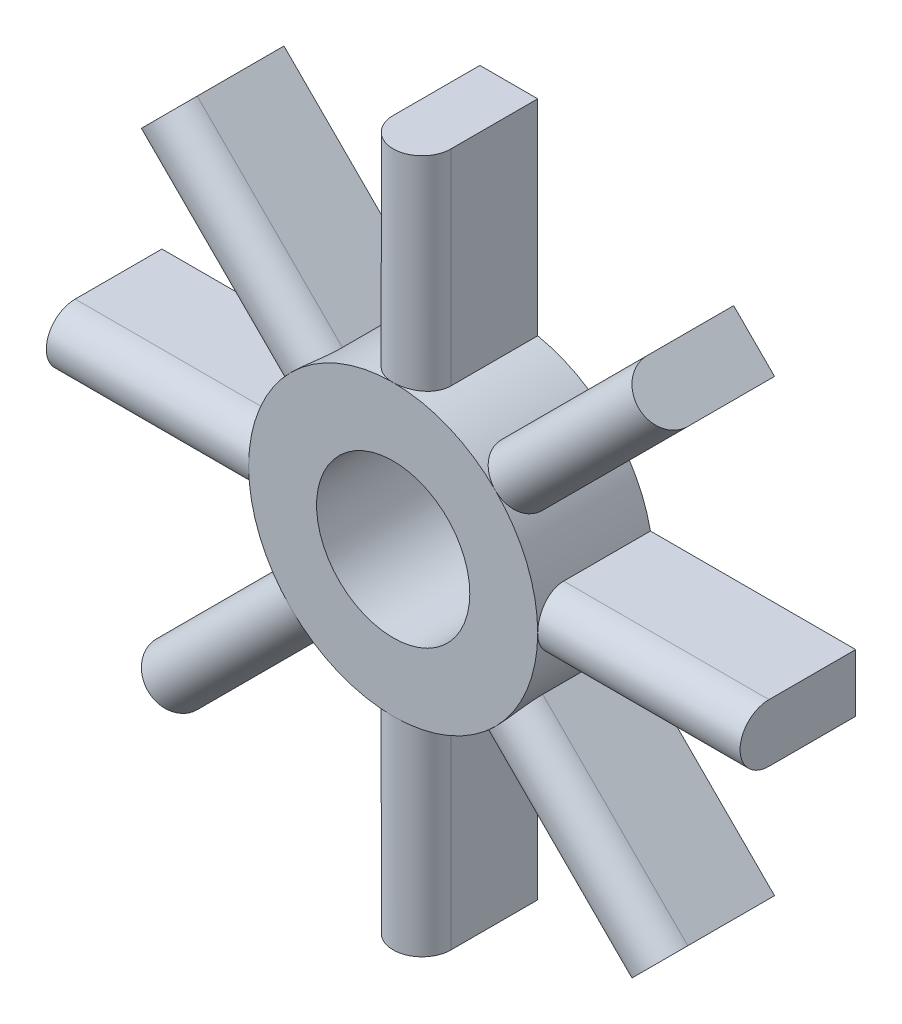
ISO-10303-21;
HEADER;
FILE_DESCRIPTION(('STEP AP214'),'2;1');
FILE_NAME('part.step','',(''),(''),'','','');
FILE_SCHEMA(('AUTOMOTIVE_DESIGN { 1 0 10303 214 1 1 1 1 }'));
ENDSEC;
DATA;
#1=APPLICATION_CONTEXT('core data for automotive mechanical design processes');
#2=APPLICATION_PROTOCOL_DEFINITION('international standard','automotive_design',2000,#1);
#3=PRODUCT_CONTEXT('',#1,'mechanical');
#4=PRODUCT('Part','Part','',(#3));
#5=PRODUCT_RELATED_PRODUCT_CATEGORY('part','',(#4));
#6=PRODUCT_DEFINITION_FORMATION('','',#4);
#7=PRODUCT_DEFINITION_CONTEXT('part definition',#1,'design');
#8=PRODUCT_DEFINITION('design','',#6,#7);
#9=PRODUCT_DEFINITION_SHAPE('','',#8);
#10=(LENGTH_UNIT() NAMED_UNIT(*) SI_UNIT(.MILLI.,.METRE.));
#11=(NAMED_UNIT(*) PLANE_ANGLE_UNIT() SI_UNIT($,.RADIAN.));
#12=(NAMED_UNIT(*) SI_UNIT($,.STERADIAN.) SOLID_ANGLE_UNIT());
#13=UNCERTAINTY_MEASURE_WITH_UNIT(LENGTH_MEASURE(1.E-05),#10,'distance_accuracy_value','');
#14=(GEOMETRIC_REPRESENTATION_CONTEXT(3) GLOBAL_UNCERTAINTY_ASSIGNED_CONTEXT((#13)) GLOBAL_UNIT_ASSIGNED_CONTEXT((#10,
#11,#12)) REPRESENTATION_CONTEXT('',''));
#15=CARTESIAN_POINT('',(0.,0.,0.));
#16=DIRECTION('',(0.,0.,1.));
#17=DIRECTION('',(1.,0.,0.));
#18=AXIS2_PLACEMENT_3D('',#15,#16,#17);
#19=CARTESIAN_POINT('',(10.9985226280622,10.9985226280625,-3.175));
#20=DIRECTION('',(-0.707106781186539,-0.707106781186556,0.));
#21=DIRECTION('',(0.707106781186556,-0.707106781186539,0.));
#22=AXIS2_PLACEMENT_3D('',#19,#20,#21);
#23=CYLINDRICAL_SURFACE('',#22,3.175);
#24=CARTESIAN_POINT('',(13.2435866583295,8.75345859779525,-3.175));
#25=CARTESIAN_POINT('',(13.2435880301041,8.75344639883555,-3.08664908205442));
#26=CARTESIAN_POINT('',(13.241511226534,8.75659837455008,-2.99830345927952));
#27=CARTESIAN_POINT('',(13.2332138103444,8.76913796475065,-2.82226226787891));
#28=CARTESIAN_POINT('',(13.2269937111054,8.77852480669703,-2.73456662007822));
#29=CARTESIAN_POINT('',(13.2104356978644,8.80342122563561,-2.56058405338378));
#30=CARTESIAN_POINT('',(13.2001044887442,8.81892083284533,-2.47429507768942));
#31=CARTESIAN_POINT('',(13.1753583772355,8.85584815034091,-2.30361619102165));
#32=CARTESIAN_POINT('',(13.1609434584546,8.8772758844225,-2.21922628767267));
#33=CARTESIAN_POINT('',(13.1116081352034,8.95013120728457,-1.9697707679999));
#34=CARTESIAN_POINT('',(13.0705843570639,9.01015069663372,-1.80828363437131));
#35=CARTESIAN_POINT('',(12.9727237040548,9.15048269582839,-1.49964140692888));
#36=CARTESIAN_POINT('',(12.9158838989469,9.230798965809,-1.35248897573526));
#37=CARTESIAN_POINT('',(12.7861602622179,9.40967922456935,-1.07454691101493));
#38=CARTESIAN_POINT('',(12.7130833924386,9.50846028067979,-0.943986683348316));
#39=CARTESIAN_POINT('',(12.5522166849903,9.7198290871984,-0.70497610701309));
#40=CARTESIAN_POINT('',(12.464426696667,9.83241697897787,-0.596525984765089));
#41=CARTESIAN_POINT('',(12.274645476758,10.0683571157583,-0.40390034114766));
#42=CARTESIAN_POINT('',(12.1725368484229,10.1917948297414,-0.319945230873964));
#43=CARTESIAN_POINT('',(11.9565666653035,10.444310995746,-0.180098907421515));
#44=CARTESIAN_POINT('',(11.8427060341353,10.5733890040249,-0.124205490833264));
#45=CARTESIAN_POINT('',(11.6661121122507,10.7668479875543,-0.0630545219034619));
#46=CARTESIAN_POINT('',(11.606695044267,10.8308818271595,-0.0464891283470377));
#47=CARTESIAN_POINT('',(11.4860406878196,10.9587500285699,-0.0207200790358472));
#48=CARTESIAN_POINT('',(11.4248034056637,11.0225843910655,-0.0115163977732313));
#49=CARTESIAN_POINT('',(11.3008531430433,11.1496287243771,-0.000554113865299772));
#50=CARTESIAN_POINT('',(11.2381381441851,11.2128376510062,0.0011936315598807));
#51=CARTESIAN_POINT('',(11.1117705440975,11.3380843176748,-0.00278463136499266));
#52=CARTESIAN_POINT('',(11.0481178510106,11.4001219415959,-0.00851137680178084));
#53=CARTESIAN_POINT('',(10.9842285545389,11.4613414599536,-0.0179750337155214));
#54=B_SPLINE_CURVE_WITH_KNOTS('',3,(#24,#25,#26,#27,#28,#29,#30,#31,#32,#33,#34,#35,#36,#37,#38,
#39,#40,#41,#42,#43,#44,#45,#46,#47,#48,#49,#50,#51,#52,#53),.UNSPECIFIED.,.F.,.F.,(4,2,2,2,2,2,
2,2,2,2,2,2,2,2,4),(0.,0.264962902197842,0.529892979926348,0.794392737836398,1.05889355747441,
1.58748718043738,2.11617880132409,2.65152858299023,3.18688384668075,3.72691743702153,
4.26690861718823,4.53337611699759,4.79984269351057,5.0666971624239,5.33357794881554),.UNSPECIFIED.);
#55=CARTESIAN_POINT('',(13.2435866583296,8.75345859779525,-3.175));
#56=VERTEX_POINT('',#55);
#57=CARTESIAN_POINT('',(11.2253201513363,11.2253201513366,0.));
#58=VERTEX_POINT('',#57);
#59=EDGE_CURVE('E48',#56,#58,#54,.T.);
#60=ORIENTED_EDGE('',*,*,#59,.F.);
#61=DIRECTION('',(-0.707106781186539,-0.707106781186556,0.));
#62=VECTOR('',#61,1.);
#63=CARTESIAN_POINT('',(29.1858323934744,24.6957043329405,-3.175));
#64=LINE('',#63,#62);
#65=CARTESIAN_POINT('',(29.1858323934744,24.6957043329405,-3.175));
#66=VERTEX_POINT('',#65);
#67=EDGE_CURVE('E577',#66,#56,#64,.T.);
#68=ORIENTED_EDGE('',*,*,#67,.F.);
#69=CARTESIAN_POINT('',(26.9407683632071,26.9407683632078,-3.175));
#70=DIRECTION('',(0.707106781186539,0.707106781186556,0.));
#71=DIRECTION('',(-0.707106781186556,0.707106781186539,0.));
#72=AXIS2_PLACEMENT_3D('',#69,#70,#71);
#73=CIRCLE('',#72,3.175);
#74=CARTESIAN_POINT('',(24.6957043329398,29.1858323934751,-3.175));
#75=VERTEX_POINT('',#74);
#76=EDGE_CURVE('E575',#75,#66,#73,.T.);
#77=ORIENTED_EDGE('',*,*,#76,.F.);
#78=DIRECTION('',(-0.707106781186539,-0.707106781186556,0.));
#79=VECTOR('',#78,1.);
#80=CARTESIAN_POINT('',(24.6957043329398,29.1858323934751,-3.175));
#81=LINE('',#80,#79);
#82=CARTESIAN_POINT('',(8.75345859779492,13.2435866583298,-3.175));
#83=VERTEX_POINT('',#82);
#84=EDGE_CURVE('E292',#83,#75,#81,.F.);
#85=ORIENTED_EDGE('',*,*,#84,.F.);
#86=CARTESIAN_POINT('',(8.75345859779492,13.2435866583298,-3.175));
#87=CARTESIAN_POINT('',(8.75344639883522,13.2435880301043,-3.08664908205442));
#88=CARTESIAN_POINT('',(8.75659837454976,13.2415112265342,-2.99830345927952));
#89=CARTESIAN_POINT('',(8.76913796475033,13.2332138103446,-2.82226226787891));
#90=CARTESIAN_POINT('',(8.7785248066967,13.2269937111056,-2.73456662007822));
#91=CARTESIAN_POINT('',(8.80342122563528,13.2104356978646,-2.56058405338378));
#92=CARTESIAN_POINT('',(8.81892083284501,13.2001044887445,-2.47429507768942));
#93=CARTESIAN_POINT('',(8.85584815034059,13.1753583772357,-2.30361619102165));
#94=CARTESIAN_POINT('',(8.87727588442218,13.1609434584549,-2.21922628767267));
#95=CARTESIAN_POINT('',(8.95013120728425,13.1116081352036,-1.9697707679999));
#96=CARTESIAN_POINT('',(9.0101506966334,13.0705843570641,-1.80828363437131));
#97=CARTESIAN_POINT('',(9.15048269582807,12.9727237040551,-1.49964140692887));
#98=CARTESIAN_POINT('',(9.23079896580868,12.9158838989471,-1.35248897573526));
#99=CARTESIAN_POINT('',(9.40967922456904,12.7861602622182,-1.07454691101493));
#100=CARTESIAN_POINT('',(9.50846028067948,12.7130833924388,-0.943986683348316));
#101=CARTESIAN_POINT('',(9.71982908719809,12.5522166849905,-0.70497610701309));
#102=CARTESIAN_POINT('',(9.83241697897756,12.4644266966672,-0.596525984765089));
#103=CARTESIAN_POINT('',(10.068357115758,12.2746454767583,-0.403900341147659));
#104=CARTESIAN_POINT('',(10.1917948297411,12.1725368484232,-0.319945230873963));
#105=CARTESIAN_POINT('',(10.4443109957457,11.9565666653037,-0.180098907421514));
#106=CARTESIAN_POINT('',(10.5733890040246,11.8427060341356,-0.124205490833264));
#107=CARTESIAN_POINT('',(10.766847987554,11.666112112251,-0.0630545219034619));
#108=CARTESIAN_POINT('',(10.8308818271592,11.6066950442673,-0.0464891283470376));
#109=CARTESIAN_POINT('',(10.9587500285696,11.4860406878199,-0.0207200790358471));
#110=CARTESIAN_POINT('',(11.0225843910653,11.424803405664,-0.0115163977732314));
#111=CARTESIAN_POINT('',(11.1496287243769,11.3008531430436,-0.000554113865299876));
#112=CARTESIAN_POINT('',(11.2128376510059,11.2381381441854,0.00119363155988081));
#113=CARTESIAN_POINT('',(11.3380843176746,11.1117705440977,-0.00278463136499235));
#114=CARTESIAN_POINT('',(11.4001219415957,11.0481178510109,-0.00851137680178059));
#115=CARTESIAN_POINT('',(11.4613414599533,10.9842285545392,-0.0179750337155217));
#116=B_SPLINE_CURVE_WITH_KNOTS('',3,(#86,#87,#88,#89,#90,#91,#92,#93,#94,#95,#96,#97,#98,#99,
#100,#101,#102,#103,#104,#105,#106,#107,#108,#109,#110,#111,#112,#113,#114,#115),.UNSPECIFIED.,
.F.,.F.,(4,2,2,2,2,2,2,2,2,2,2,2,2,2,4),(0.,0.264962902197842,0.529892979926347,
0.794392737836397,1.05889355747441,1.58748718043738,2.11617880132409,2.65152858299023,
3.18688384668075,3.72691743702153,4.26690861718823,4.53337611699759,4.79984269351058,
5.06669716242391,5.33357794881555),.UNSPECIFIED.);
#117=EDGE_CURVE('E11',#83,#58,#116,.T.);
#118=ORIENTED_EDGE('',*,*,#117,.T.);
#119=EDGE_LOOP('',(#60,#68,#77,#85,#118));
#120=FACE_BOUND('',#119,.T.);
#121=ADVANCED_FACE('F35',(#120),#23,.T.);
#122=CARTESIAN_POINT('',(15.5542598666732,1.62847166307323E-13,-3.175));
#123=DIRECTION('',(-1.,0.,0.));
#124=DIRECTION('',(0.,-1.,0.));
#125=AXIS2_PLACEMENT_3D('',#122,#123,#124);
#126=CYLINDRICAL_SURFACE('',#125,3.175);
#127=CARTESIAN_POINT('',(15.5542598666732,-3.17499999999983,-3.175));
#128=CARTESIAN_POINT('',(15.5542522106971,-3.17500959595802,-3.08664908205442));
#129=CARTESIAN_POINT('',(15.5550124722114,-3.17131229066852,-2.99830345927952));
#130=CARTESIAN_POINT('',(15.5580121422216,-3.15657830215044,-2.82226226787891));
#131=CARTESIAN_POINT('',(15.5602513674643,-3.1455425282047,-2.73456662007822));
#132=CARTESIAN_POINT('',(15.5661475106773,-3.11622981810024,-2.56058405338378));
#133=CARTESIAN_POINT('',(15.5698021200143,-3.09796467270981,-2.47429507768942));
#134=CARTESIAN_POINT('',(15.5784155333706,-3.05435497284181,-2.30361619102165));
#135=CARTESIAN_POINT('',(15.583374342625,-3.02901038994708,-2.21922628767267));
#136=CARTESIAN_POINT('',(15.6000054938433,-2.94260855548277,-1.9697707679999));
#137=CARTESIAN_POINT('',(15.6134374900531,-2.87116017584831,-1.80828363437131));
#138=CARTESIAN_POINT('',(15.643469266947,-2.70273253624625,-1.49964140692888));
#139=CARTESIAN_POINT('',(15.6600696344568,-2.60574854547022,-1.35248897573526));
#140=CARTESIAN_POINT('',(15.6948286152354,-2.38753263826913,-1.07454691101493));
#141=CARTESIAN_POINT('',(15.713004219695,-2.26601073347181,-0.943986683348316));
#142=CARTESIAN_POINT('',(15.7487145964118,-2.00280047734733,-0.70497610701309));
#143=CARTESIAN_POINT('',(15.7662493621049,-1.86111191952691,-0.596525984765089));
#144=CARTESIAN_POINT('',(15.7988886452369,-1.5600814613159,-0.40390034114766));
#145=CARTESIAN_POINT('',(15.8139705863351,-1.40059611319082,-0.319945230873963));
#146=CARTESIAN_POINT('',(15.8398124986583,-1.06932623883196,-0.180098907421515));
#147=CARTESIAN_POINT('',(15.8505728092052,-0.897542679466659,-0.124205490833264));
#148=CARTESIAN_POINT('',(15.8624982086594,-0.63587576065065,-0.0630545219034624));
#149=CARTESIAN_POINT('',(15.8657627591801,-0.548582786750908,-0.0464891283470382));
#150=CARTESIAN_POINT('',(15.8708637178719,-0.372850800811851,-0.0207200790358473));
#151=CARTESIAN_POINT('',(15.8727001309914,-0.284411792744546,-0.0115163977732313));
#152=CARTESIAN_POINT('',(15.8748879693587,-0.106931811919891,-0.000554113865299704));
#153=CARTESIAN_POINT('',(15.8752372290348,-0.0178901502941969,0.00119363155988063));
#154=CARTESIAN_POINT('',(15.874444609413,0.160028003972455,-0.00278463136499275));
#155=CARTESIAN_POINT('',(15.8733025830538,0.248904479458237,-0.00851137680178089));
#156=CARTESIAN_POINT('',(15.8714147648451,0.337369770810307,-0.0179750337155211));
#157=B_SPLINE_CURVE_WITH_KNOTS('',3,(#127,#128,#129,#130,#131,#132,#133,#134,#135,#136,#137,
#138,#139,#140,#141,#142,#143,#144,#145,#146,#147,#148,#149,#150,#151,#152,#153,#154,#155,#156),
.UNSPECIFIED.,.F.,.F.,(4,2,2,2,2,2,2,2,2,2,2,2,2,2,4),(0.,0.264962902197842,0.529892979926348,
0.794392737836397,1.05889355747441,1.58748718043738,2.11617880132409,2.65152858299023,
3.18688384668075,3.72691743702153,4.26690861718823,4.53337611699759,4.79984269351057,
5.0666971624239,5.33357794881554),.UNSPECIFIED.);
#158=CARTESIAN_POINT('',(15.5542598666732,-3.17499999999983,-3.175));
#159=VERTEX_POINT('',#158);
#160=CARTESIAN_POINT('',(15.875,0.,0.));
#161=VERTEX_POINT('',#160);
#162=EDGE_CURVE('E560',#159,#161,#157,.T.);
#163=ORIENTED_EDGE('',*,*,#162,.F.);
#164=DIRECTION('',(-1.,0.,0.));
#165=VECTOR('',#164,1.);
#166=CARTESIAN_POINT('',(38.1,-3.1749999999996,-3.175));
#167=LINE('',#166,#165);
#168=CARTESIAN_POINT('',(38.1,-3.1749999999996,-3.175));
#169=VERTEX_POINT('',#168);
#170=EDGE_CURVE('E584',#169,#159,#167,.T.);
#171=ORIENTED_EDGE('',*,*,#170,.F.);
#172=CARTESIAN_POINT('',(38.1,4.02037025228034E-13,-3.175));
#173=DIRECTION('',(1.,0.,0.));
#174=DIRECTION('',(0.,1.,0.));
#175=AXIS2_PLACEMENT_3D('',#172,#173,#174);
#176=CIRCLE('',#175,3.175);
#177=CARTESIAN_POINT('',(38.1,3.1750000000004,-3.175));
#178=VERTEX_POINT('',#177);
#179=EDGE_CURVE('E582',#178,#169,#176,.T.);
#180=ORIENTED_EDGE('',*,*,#179,.F.);
#181=DIRECTION('',(-1.,0.,0.));
#182=VECTOR('',#181,1.);
#183=CARTESIAN_POINT('',(38.1,3.1750000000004,-3.175));
#184=LINE('',#183,#182);
#185=CARTESIAN_POINT('',(15.5542598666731,3.17500000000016,-3.175));
#186=VERTEX_POINT('',#185);
#187=EDGE_CURVE('E589',#186,#178,#184,.F.);
#188=ORIENTED_EDGE('',*,*,#187,.F.);
#189=CARTESIAN_POINT('',(15.5542598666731,3.17500000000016,-3.175));
#190=CARTESIAN_POINT('',(15.5542522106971,3.17500959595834,-3.08664908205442));
#191=CARTESIAN_POINT('',(15.5550124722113,3.17131229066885,-2.99830345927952));
#192=CARTESIAN_POINT('',(15.5580121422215,3.15657830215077,-2.82226226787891));
#193=CARTESIAN_POINT('',(15.5602513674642,3.14554252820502,-2.73456662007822));
#194=CARTESIAN_POINT('',(15.5661475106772,3.11622981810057,-2.56058405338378));
#195=CARTESIAN_POINT('',(15.5698021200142,3.09796467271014,-2.47429507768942));
#196=CARTESIAN_POINT('',(15.5784155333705,3.05435497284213,-2.30361619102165));
#197=CARTESIAN_POINT('',(15.5833743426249,3.0290103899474,-2.21922628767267));
#198=CARTESIAN_POINT('',(15.6000054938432,2.9426085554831,-1.9697707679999));
#199=CARTESIAN_POINT('',(15.613437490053,2.87116017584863,-1.80828363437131));
#200=CARTESIAN_POINT('',(15.643469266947,2.70273253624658,-1.49964140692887));
#201=CARTESIAN_POINT('',(15.6600696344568,2.60574854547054,-1.35248897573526));
#202=CARTESIAN_POINT('',(15.6948286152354,2.38753263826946,-1.07454691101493));
#203=CARTESIAN_POINT('',(15.713004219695,2.26601073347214,-0.943986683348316));
#204=CARTESIAN_POINT('',(15.7487145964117,2.00280047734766,-0.70497610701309));
#205=CARTESIAN_POINT('',(15.7662493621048,1.86111191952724,-0.596525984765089));
#206=CARTESIAN_POINT('',(15.7988886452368,1.56008146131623,-0.403900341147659));
#207=CARTESIAN_POINT('',(15.8139705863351,1.40059611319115,-0.319945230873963));
#208=CARTESIAN_POINT('',(15.8398124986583,1.06932623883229,-0.180098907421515));
#209=CARTESIAN_POINT('',(15.8505728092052,0.897542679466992,-0.124205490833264));
#210=CARTESIAN_POINT('',(15.8624982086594,0.635875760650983,-0.063054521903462));
#211=CARTESIAN_POINT('',(15.8657627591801,0.548582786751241,-0.0464891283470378));
#212=CARTESIAN_POINT('',(15.8708637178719,0.372850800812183,-0.0207200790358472));
#213=CARTESIAN_POINT('',(15.8727001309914,0.284411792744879,-0.0115163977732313));
#214=CARTESIAN_POINT('',(15.8748879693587,0.106931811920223,-0.000554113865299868));
#215=CARTESIAN_POINT('',(15.8752372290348,0.0178901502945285,0.00119363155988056));
#216=CARTESIAN_POINT('',(15.874444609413,-0.160028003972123,-0.00278463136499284));
#217=CARTESIAN_POINT('',(15.8733025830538,-0.248904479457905,-0.00851137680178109));
#218=CARTESIAN_POINT('',(15.8714147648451,-0.337369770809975,-0.0179750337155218));
#219=B_SPLINE_CURVE_WITH_KNOTS('',3,(#189,#190,#191,#192,#193,#194,#195,#196,#197,#198,#199,
#200,#201,#202,#203,#204,#205,#206,#207,#208,#209,#210,#211,#212,#213,#214,#215,#216,#217,#218),
.UNSPECIFIED.,.F.,.F.,(4,2,2,2,2,2,2,2,2,2,2,2,2,2,4),(0.,0.264962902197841,0.529892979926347,
0.794392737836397,1.05889355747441,1.58748718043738,2.11617880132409,2.65152858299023,
3.18688384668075,3.72691743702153,4.26690861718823,4.53337611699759,4.79984269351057,
5.0666971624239,5.33357794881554),.UNSPECIFIED.);
#220=EDGE_CURVE('E566',#186,#161,#219,.T.);
#221=ORIENTED_EDGE('',*,*,#220,.T.);
#222=EDGE_LOOP('',(#163,#171,#180,#188,#221));
#223=FACE_BOUND('',#222,.T.);
#224=ADVANCED_FACE('F702',(#223),#126,.T.);
#225=CARTESIAN_POINT('',(10.9985226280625,-10.9985226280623,-3.175));
#226=DIRECTION('',(-0.707106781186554,0.707106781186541,0.));
#227=DIRECTION('',(-0.707106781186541,-0.707106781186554,0.));
#228=AXIS2_PLACEMENT_3D('',#225,#226,#227);
#229=CYLINDRICAL_SURFACE('',#228,3.175);
#230=CARTESIAN_POINT('',(8.7534585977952,-13.2435866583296,-3.175));
#231=CARTESIAN_POINT('',(8.7534463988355,-13.2435880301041,-3.08664908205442));
#232=CARTESIAN_POINT('',(8.75659837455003,-13.241511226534,-2.99830345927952));
#233=CARTESIAN_POINT('',(8.7691379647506,-13.2332138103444,-2.82226226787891));
#234=CARTESIAN_POINT('',(8.77852480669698,-13.2269937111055,-2.73456662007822));
#235=CARTESIAN_POINT('',(8.80342122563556,-13.2104356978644,-2.56058405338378));
#236=CARTESIAN_POINT('',(8.81892083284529,-13.2001044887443,-2.47429507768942));
#237=CARTESIAN_POINT('',(8.85584815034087,-13.1753583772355,-2.30361619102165));
#238=CARTESIAN_POINT('',(8.87727588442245,-13.1609434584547,-2.21922628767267));
#239=CARTESIAN_POINT('',(8.95013120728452,-13.1116081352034,-1.9697707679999));
#240=CARTESIAN_POINT('',(9.01015069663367,-13.0705843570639,-1.80828363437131));
#241=CARTESIAN_POINT('',(9.15048269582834,-12.9727237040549,-1.49964140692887));
#242=CARTESIAN_POINT('',(9.23079896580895,-12.9158838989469,-1.35248897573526));
#243=CARTESIAN_POINT('',(9.40967922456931,-12.786160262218,-1.07454691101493));
#244=CARTESIAN_POINT('',(9.50846028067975,-12.7130833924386,-0.943986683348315));
#245=CARTESIAN_POINT('',(9.71982908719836,-12.5522166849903,-0.70497610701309));
#246=CARTESIAN_POINT('',(9.83241697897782,-12.464426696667,-0.596525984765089));
#247=CARTESIAN_POINT('',(10.0683571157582,-12.274645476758,-0.40390034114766));
#248=CARTESIAN_POINT('',(10.1917948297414,-12.1725368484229,-0.319945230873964));
#249=CARTESIAN_POINT('',(10.4443109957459,-11.9565666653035,-0.180098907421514));
#250=CARTESIAN_POINT('',(10.5733890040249,-11.8427060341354,-0.124205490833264));
#251=CARTESIAN_POINT('',(10.7668479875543,-11.6661121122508,-0.0630545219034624));
#252=CARTESIAN_POINT('',(10.8308818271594,-11.606695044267,-0.0464891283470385));
#253=CARTESIAN_POINT('',(10.9587500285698,-11.4860406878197,-0.0207200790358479));
#254=CARTESIAN_POINT('',(11.0225843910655,-11.4248034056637,-0.011516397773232));
#255=CARTESIAN_POINT('',(11.1496287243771,-11.3008531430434,-0.000554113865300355));
#256=CARTESIAN_POINT('',(11.2128376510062,-11.2381381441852,0.00119363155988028));
#257=CARTESIAN_POINT('',(11.3380843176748,-11.1117705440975,-0.00278463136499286));
#258=CARTESIAN_POINT('',(11.4001219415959,-11.0481178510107,-0.00851137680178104));
#259=CARTESIAN_POINT('',(11.4613414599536,-10.984228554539,-0.0179750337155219));
#260=B_SPLINE_CURVE_WITH_KNOTS('',3,(#230,#231,#232,#233,#234,#235,#236,#237,#238,#239,#240,
#241,#242,#243,#244,#245,#246,#247,#248,#249,#250,#251,#252,#253,#254,#255,#256,#257,#258,#259),
.UNSPECIFIED.,.F.,.F.,(4,2,2,2,2,2,2,2,2,2,2,2,2,2,4),(0.,0.264962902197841,0.529892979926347,
0.794392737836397,1.05889355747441,1.58748718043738,2.11617880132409,2.65152858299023,
3.18688384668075,3.72691743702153,4.26690861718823,4.53337611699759,4.79984269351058,
5.06669716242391,5.33357794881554),.UNSPECIFIED.);
#261=CARTESIAN_POINT('',(8.7534585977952,-13.2435866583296,-3.175));
#262=VERTEX_POINT('',#261);
#263=CARTESIAN_POINT('',(11.2253201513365,-11.2253201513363,0.));
#264=VERTEX_POINT('',#263);
#265=EDGE_CURVE('E545',#262,#264,#260,.T.);
#266=ORIENTED_EDGE('',*,*,#265,.F.);
#267=DIRECTION('',(-0.707106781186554,0.707106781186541,0.));
#268=VECTOR('',#267,1.);
#269=CARTESIAN_POINT('',(24.6957043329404,-29.1858323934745,-3.175));
#270=LINE('',#269,#268);
#271=CARTESIAN_POINT('',(24.6957043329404,-29.1858323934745,-3.175));
#272=VERTEX_POINT('',#271);
#273=EDGE_CURVE('E600',#272,#262,#270,.T.);
#274=ORIENTED_EDGE('',*,*,#273,.F.);
#275=CARTESIAN_POINT('',(26.9407683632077,-26.9407683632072,-3.175));
#276=DIRECTION('',(0.707106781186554,-0.707106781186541,0.));
#277=DIRECTION('',(0.707106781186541,0.707106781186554,0.));
#278=AXIS2_PLACEMENT_3D('',#275,#276,#277);
#279=CIRCLE('',#278,3.175);
#280=CARTESIAN_POINT('',(29.185832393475,-24.6957043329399,-3.175));
#281=VERTEX_POINT('',#280);
#282=EDGE_CURVE('E598',#281,#272,#279,.T.);
#283=ORIENTED_EDGE('',*,*,#282,.F.);
#284=DIRECTION('',(-0.707106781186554,0.707106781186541,0.));
#285=VECTOR('',#284,1.);
#286=CARTESIAN_POINT('',(29.185832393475,-24.6957043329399,-3.175));
#287=LINE('',#286,#285);
#288=CARTESIAN_POINT('',(13.2435866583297,-8.75345859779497,-3.175));
#289=VERTEX_POINT('',#288);
#290=EDGE_CURVE('E605',#289,#281,#287,.F.);
#291=ORIENTED_EDGE('',*,*,#290,.F.);
#292=CARTESIAN_POINT('',(13.2435866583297,-8.75345859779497,-3.175));
#293=CARTESIAN_POINT('',(13.2435880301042,-8.75344639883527,-3.08664908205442));
#294=CARTESIAN_POINT('',(13.2415112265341,-8.7565983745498,-2.99830345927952));
#295=CARTESIAN_POINT('',(13.2332138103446,-8.76913796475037,-2.82226226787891));
#296=CARTESIAN_POINT('',(13.2269937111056,-8.77852480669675,-2.73456662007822));
#297=CARTESIAN_POINT('',(13.2104356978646,-8.80342122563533,-2.56058405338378));
#298=CARTESIAN_POINT('',(13.2001044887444,-8.81892083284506,-2.47429507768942));
#299=CARTESIAN_POINT('',(13.1753583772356,-8.85584815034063,-2.30361619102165));
#300=CARTESIAN_POINT('',(13.1609434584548,-8.87727588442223,-2.21922628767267));
#301=CARTESIAN_POINT('',(13.1116081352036,-8.95013120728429,-1.9697707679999));
#302=CARTESIAN_POINT('',(13.0705843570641,-9.01015069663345,-1.80828363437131));
#303=CARTESIAN_POINT('',(12.972723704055,-9.15048269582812,-1.49964140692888));
#304=CARTESIAN_POINT('',(12.9158838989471,-9.23079896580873,-1.35248897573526));
#305=CARTESIAN_POINT('',(12.7861602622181,-9.40967922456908,-1.07454691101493));
#306=CARTESIAN_POINT('',(12.7130833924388,-9.50846028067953,-0.943986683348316));
#307=CARTESIAN_POINT('',(12.5522166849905,-9.71982908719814,-0.704976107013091));
#308=CARTESIAN_POINT('',(12.4644266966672,-9.8324169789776,-0.59652598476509));
#309=CARTESIAN_POINT('',(12.2746454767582,-10.068357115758,-0.40390034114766));
#310=CARTESIAN_POINT('',(12.1725368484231,-10.1917948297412,-0.319945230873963));
#311=CARTESIAN_POINT('',(11.9565666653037,-10.4443109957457,-0.180098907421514));
#312=CARTESIAN_POINT('',(11.8427060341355,-10.5733890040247,-0.124205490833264));
#313=CARTESIAN_POINT('',(11.666112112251,-10.7668479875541,-0.0630545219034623));
#314=CARTESIAN_POINT('',(11.6066950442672,-10.8308818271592,-0.0464891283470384));
#315=CARTESIAN_POINT('',(11.4860406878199,-10.9587500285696,-0.0207200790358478));
#316=CARTESIAN_POINT('',(11.4248034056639,-11.0225843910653,-0.0115163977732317));
#317=CARTESIAN_POINT('',(11.3008531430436,-11.1496287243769,-0.000554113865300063));
#318=CARTESIAN_POINT('',(11.2381381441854,-11.212837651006,0.00119363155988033));
#319=CARTESIAN_POINT('',(11.1117705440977,-11.3380843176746,-0.00278463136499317));
#320=CARTESIAN_POINT('',(11.0481178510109,-11.4001219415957,-0.00851137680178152));
#321=CARTESIAN_POINT('',(10.9842285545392,-11.4613414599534,-0.0179750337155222));
#322=B_SPLINE_CURVE_WITH_KNOTS('',3,(#292,#293,#294,#295,#296,#297,#298,#299,#300,#301,#302,
#303,#304,#305,#306,#307,#308,#309,#310,#311,#312,#313,#314,#315,#316,#317,#318,#319,#320,#321),
.UNSPECIFIED.,.F.,.F.,(4,2,2,2,2,2,2,2,2,2,2,2,2,2,4),(0.,0.264962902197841,0.529892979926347,
0.794392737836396,1.05889355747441,1.58748718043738,2.11617880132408,2.65152858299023,
3.18688384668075,3.72691743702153,4.26690861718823,4.53337611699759,4.79984269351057,
5.0666971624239,5.33357794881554),.UNSPECIFIED.);
#323=EDGE_CURVE('E553',#289,#264,#322,.T.);
#324=ORIENTED_EDGE('',*,*,#323,.T.);
#325=EDGE_LOOP('',(#266,#274,#283,#291,#324));
#326=FACE_BOUND('',#325,.T.);
#327=ADVANCED_FACE('F706',(#326),#229,.T.);
#328=CARTESIAN_POINT('',(0.,-15.5542598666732,-3.175));
#329=DIRECTION('',(0.,1.,0.));
#330=DIRECTION('',(-1.,0.,0.));
#331=AXIS2_PLACEMENT_3D('',#328,#329,#330);
#332=CYLINDRICAL_SURFACE('',#331,3.175);
#333=CARTESIAN_POINT('',(-3.175,-15.5542598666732,-3.175));
#334=CARTESIAN_POINT('',(-3.17500959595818,-15.5542522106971,-3.08664908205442));
#335=CARTESIAN_POINT('',(-3.17131229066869,-15.5550124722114,-2.99830345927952));
#336=CARTESIAN_POINT('',(-3.1565783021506,-15.5580121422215,-2.82226226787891));
#337=CARTESIAN_POINT('',(-3.14554252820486,-15.5602513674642,-2.73456662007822));
#338=CARTESIAN_POINT('',(-3.1162298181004,-15.5661475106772,-2.56058405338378));
#339=CARTESIAN_POINT('',(-3.09796467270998,-15.5698021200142,-2.47429507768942));
#340=CARTESIAN_POINT('',(-3.05435497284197,-15.5784155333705,-2.30361619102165));
#341=CARTESIAN_POINT('',(-3.02901038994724,-15.5833743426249,-2.21922628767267));
#342=CARTESIAN_POINT('',(-2.94260855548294,-15.6000054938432,-1.9697707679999));
#343=CARTESIAN_POINT('',(-2.87116017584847,-15.613437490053,-1.80828363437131));
#344=CARTESIAN_POINT('',(-2.70273253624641,-15.643469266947,-1.49964140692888));
#345=CARTESIAN_POINT('',(-2.60574854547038,-15.6600696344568,-1.35248897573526));
#346=CARTESIAN_POINT('',(-2.3875326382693,-15.6948286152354,-1.07454691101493));
#347=CARTESIAN_POINT('',(-2.26601073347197,-15.713004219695,-0.943986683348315));
#348=CARTESIAN_POINT('',(-2.0028004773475,-15.7487145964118,-0.70497610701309));
#349=CARTESIAN_POINT('',(-1.86111191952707,-15.7662493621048,-0.596525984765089));
#350=CARTESIAN_POINT('',(-1.56008146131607,-15.7988886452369,-0.40390034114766));
#351=CARTESIAN_POINT('',(-1.40059611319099,-15.8139705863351,-0.319945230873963));
#352=CARTESIAN_POINT('',(-1.06932623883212,-15.8398124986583,-0.180098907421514));
#353=CARTESIAN_POINT('',(-0.897542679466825,-15.8505728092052,-0.124205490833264));
#354=CARTESIAN_POINT('',(-0.635875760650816,-15.8624982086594,-0.0630545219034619));
#355=CARTESIAN_POINT('',(-0.548582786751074,-15.8657627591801,-0.0464891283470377));
#356=CARTESIAN_POINT('',(-0.372850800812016,-15.8708637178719,-0.020720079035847));
#357=CARTESIAN_POINT('',(-0.284411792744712,-15.8727001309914,-0.0115163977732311));
#358=CARTESIAN_POINT('',(-0.106931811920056,-15.8748879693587,-0.000554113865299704));
#359=CARTESIAN_POINT('',(-0.0178901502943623,-15.8752372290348,0.00119363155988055));
#360=CARTESIAN_POINT('',(0.160028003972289,-15.874444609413,-0.00278463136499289));
#361=CARTESIAN_POINT('',(0.248904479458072,-15.8733025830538,-0.00851137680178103));
#362=CARTESIAN_POINT('',(0.337369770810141,-15.8714147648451,-0.0179750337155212));
#363=B_SPLINE_CURVE_WITH_KNOTS('',3,(#333,#334,#335,#336,#337,#338,#339,#340,#341,#342,#343,
#344,#345,#346,#347,#348,#349,#350,#351,#352,#353,#354,#355,#356,#357,#358,#359,#360,#361,#362),
.UNSPECIFIED.,.F.,.F.,(4,2,2,2,2,2,2,2,2,2,2,2,2,2,4),(0.,0.264962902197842,0.529892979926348,
0.794392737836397,1.05889355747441,1.58748718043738,2.11617880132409,2.65152858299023,
3.18688384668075,3.72691743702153,4.26690861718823,4.53337611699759,4.79984269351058,
5.0666971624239,5.33357794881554),.UNSPECIFIED.);
#364=CARTESIAN_POINT('',(-3.175,-15.5542598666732,-3.175));
#365=VERTEX_POINT('',#364);
#366=CARTESIAN_POINT('',(0.,-15.875,0.));
#367=VERTEX_POINT('',#366);
#368=EDGE_CURVE('E530',#365,#367,#363,.T.);
#369=ORIENTED_EDGE('',*,*,#368,.F.);
#370=DIRECTION('',(0.,1.,0.));
#371=VECTOR('',#370,1.);
#372=CARTESIAN_POINT('',(-3.175,-38.1,-3.175));
#373=LINE('',#372,#371);
#374=CARTESIAN_POINT('',(-3.175,-38.1,-3.175));
#375=VERTEX_POINT('',#374);
#376=EDGE_CURVE('E616',#375,#365,#373,.T.);
#377=ORIENTED_EDGE('',*,*,#376,.F.);
#378=CARTESIAN_POINT('',(0.,-38.1,-3.175));
#379=DIRECTION('',(0.,-1.,0.));
#380=DIRECTION('',(0.,0.,-1.));
#381=AXIS2_PLACEMENT_3D('',#378,#379,#380);
#382=CIRCLE('',#381,3.175);
#383=CARTESIAN_POINT('',(3.175,-38.1,-3.175));
#384=VERTEX_POINT('',#383);
#385=EDGE_CURVE('E614',#384,#375,#382,.T.);
#386=ORIENTED_EDGE('',*,*,#385,.F.);
#387=DIRECTION('',(0.,1.,0.));
#388=VECTOR('',#387,1.);
#389=CARTESIAN_POINT('',(3.175,-38.1,-3.175));
#390=LINE('',#389,#388);
#391=CARTESIAN_POINT('',(3.175,-15.5542598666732,-3.175));
#392=VERTEX_POINT('',#391);
#393=EDGE_CURVE('E621',#392,#384,#390,.F.);
#394=ORIENTED_EDGE('',*,*,#393,.F.);
#395=CARTESIAN_POINT('',(3.175,-15.5542598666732,-3.175));
#396=CARTESIAN_POINT('',(3.17500959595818,-15.5542522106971,-3.08664908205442));
#397=CARTESIAN_POINT('',(3.17131229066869,-15.5550124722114,-2.99830345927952));
#398=CARTESIAN_POINT('',(3.1565783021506,-15.5580121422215,-2.82226226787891));
#399=CARTESIAN_POINT('',(3.14554252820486,-15.5602513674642,-2.73456662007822));
#400=CARTESIAN_POINT('',(3.1162298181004,-15.5661475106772,-2.56058405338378));
#401=CARTESIAN_POINT('',(3.09796467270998,-15.5698021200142,-2.47429507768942));
#402=CARTESIAN_POINT('',(3.05435497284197,-15.5784155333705,-2.30361619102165));
#403=CARTESIAN_POINT('',(3.02901038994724,-15.5833743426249,-2.21922628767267));
#404=CARTESIAN_POINT('',(2.94260855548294,-15.6000054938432,-1.9697707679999));
#405=CARTESIAN_POINT('',(2.87116017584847,-15.613437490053,-1.80828363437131));
#406=CARTESIAN_POINT('',(2.70273253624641,-15.643469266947,-1.49964140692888));
#407=CARTESIAN_POINT('',(2.60574854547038,-15.6600696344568,-1.35248897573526));
#408=CARTESIAN_POINT('',(2.3875326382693,-15.6948286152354,-1.07454691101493));
#409=CARTESIAN_POINT('',(2.26601073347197,-15.713004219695,-0.943986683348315));
#410=CARTESIAN_POINT('',(2.0028004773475,-15.7487145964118,-0.70497610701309));
#411=CARTESIAN_POINT('',(1.86111191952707,-15.7662493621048,-0.596525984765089));
#412=CARTESIAN_POINT('',(1.56008146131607,-15.7988886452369,-0.40390034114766));
#413=CARTESIAN_POINT('',(1.40059611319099,-15.8139705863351,-0.319945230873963));
#414=CARTESIAN_POINT('',(1.06932623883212,-15.8398124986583,-0.180098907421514));
#415=CARTESIAN_POINT('',(0.897542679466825,-15.8505728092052,-0.124205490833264));
#416=CARTESIAN_POINT('',(0.635875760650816,-15.8624982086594,-0.0630545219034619));
#417=CARTESIAN_POINT('',(0.548582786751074,-15.8657627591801,-0.0464891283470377));
#418=CARTESIAN_POINT('',(0.372850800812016,-15.8708637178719,-0.0207200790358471));
#419=CARTESIAN_POINT('',(0.284411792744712,-15.8727001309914,-0.0115163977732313));
#420=CARTESIAN_POINT('',(0.106931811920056,-15.8748879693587,-0.000554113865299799));
#421=CARTESIAN_POINT('',(0.0178901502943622,-15.8752372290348,0.00119363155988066));
#422=CARTESIAN_POINT('',(-0.160028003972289,-15.874444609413,-0.00278463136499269));
#423=CARTESIAN_POINT('',(-0.248904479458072,-15.8733025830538,-0.00851137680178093));
#424=CARTESIAN_POINT('',(-0.337369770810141,-15.8714147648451,-0.0179750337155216));
#425=B_SPLINE_CURVE_WITH_KNOTS('',3,(#395,#396,#397,#398,#399,#400,#401,#402,#403,#404,#405,
#406,#407,#408,#409,#410,#411,#412,#413,#414,#415,#416,#417,#418,#419,#420,#421,#422,#423,#424),
.UNSPECIFIED.,.F.,.F.,(4,2,2,2,2,2,2,2,2,2,2,2,2,2,4),(0.,0.264962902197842,0.529892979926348,
0.794392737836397,1.05889355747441,1.58748718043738,2.11617880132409,2.65152858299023,
3.18688384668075,3.72691743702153,4.26690861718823,4.53337611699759,4.79984269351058,
5.0666971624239,5.33357794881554),.UNSPECIFIED.);
#426=EDGE_CURVE('E538',#392,#367,#425,.T.);
#427=ORIENTED_EDGE('',*,*,#426,.T.);
#428=EDGE_LOOP('',(#369,#377,#386,#394,#427));
#429=FACE_BOUND('',#428,.T.);
#430=ADVANCED_FACE('F710',(#429),#332,.T.);
#431=CARTESIAN_POINT('',(-10.9985226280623,-10.9985226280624,-3.175));
#432=DIRECTION('',(0.707106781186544,0.707106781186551,0.));
#433=DIRECTION('',(-0.707106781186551,0.707106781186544,0.));
#434=AXIS2_PLACEMENT_3D('',#431,#432,#433);
#435=CYLINDRICAL_SURFACE('',#434,3.175);
#436=CARTESIAN_POINT('',(-13.2435866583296,-8.75345859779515,-3.175));
#437=CARTESIAN_POINT('',(-13.2435880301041,-8.75344639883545,-3.08664908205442));
#438=CARTESIAN_POINT('',(-13.241511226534,-8.75659837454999,-2.99830345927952));
#439=CARTESIAN_POINT('',(-13.2332138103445,-8.76913796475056,-2.82226226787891));
#440=CARTESIAN_POINT('',(-13.2269937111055,-8.77852480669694,-2.73456662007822));
#441=CARTESIAN_POINT('',(-13.2104356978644,-8.80342122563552,-2.56058405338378));
#442=CARTESIAN_POINT('',(-13.2001044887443,-8.81892083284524,-2.47429507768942));
#443=CARTESIAN_POINT('',(-13.1753583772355,-8.85584815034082,-2.30361619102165));
#444=CARTESIAN_POINT('',(-13.1609434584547,-8.87727588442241,-2.21922628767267));
#445=CARTESIAN_POINT('',(-13.1116081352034,-8.95013120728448,-1.9697707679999));
#446=CARTESIAN_POINT('',(-13.0705843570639,-9.01015069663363,-1.80828363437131));
#447=CARTESIAN_POINT('',(-12.9727237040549,-9.1504826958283,-1.49964140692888));
#448=CARTESIAN_POINT('',(-12.915883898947,-9.23079896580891,-1.35248897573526));
#449=CARTESIAN_POINT('',(-12.786160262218,-9.40967922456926,-1.07454691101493));
#450=CARTESIAN_POINT('',(-12.7130833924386,-9.5084602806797,-0.943986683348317));
#451=CARTESIAN_POINT('',(-12.5522166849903,-9.71982908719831,-0.704976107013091));
#452=CARTESIAN_POINT('',(-12.4644266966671,-9.83241697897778,-0.59652598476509));
#453=CARTESIAN_POINT('',(-12.2746454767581,-10.0683571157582,-0.40390034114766));
#454=CARTESIAN_POINT('',(-12.172536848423,-10.1917948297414,-0.319945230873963));
#455=CARTESIAN_POINT('',(-11.9565666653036,-10.4443109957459,-0.180098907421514));
#456=CARTESIAN_POINT('',(-11.8427060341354,-10.5733890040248,-0.124205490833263));
#457=CARTESIAN_POINT('',(-11.6661121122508,-10.7668479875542,-0.0630545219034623));
#458=CARTESIAN_POINT('',(-11.6066950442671,-10.8308818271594,-0.0464891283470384));
#459=CARTESIAN_POINT('',(-11.4860406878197,-10.9587500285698,-0.0207200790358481));
#460=CARTESIAN_POINT('',(-11.4248034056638,-11.0225843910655,-0.0115163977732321));
#461=CARTESIAN_POINT('',(-11.3008531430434,-11.1496287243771,-0.000554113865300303));
#462=CARTESIAN_POINT('',(-11.2381381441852,-11.2128376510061,0.00119363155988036));
#463=CARTESIAN_POINT('',(-11.1117705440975,-11.3380843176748,-0.00278463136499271));
#464=CARTESIAN_POINT('',(-11.0481178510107,-11.4001219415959,-0.00851137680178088));
#465=CARTESIAN_POINT('',(-10.984228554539,-11.4613414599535,-0.0179750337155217));
#466=B_SPLINE_CURVE_WITH_KNOTS('',3,(#436,#437,#438,#439,#440,#441,#442,#443,#444,#445,#446,
#447,#448,#449,#450,#451,#452,#453,#454,#455,#456,#457,#458,#459,#460,#461,#462,#463,#464,#465),
.UNSPECIFIED.,.F.,.F.,(4,2,2,2,2,2,2,2,2,2,2,2,2,2,4),(0.,0.264962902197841,0.529892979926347,
0.794392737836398,1.05889355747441,1.58748718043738,2.11617880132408,2.65152858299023,
3.18688384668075,3.72691743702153,4.26690861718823,4.53337611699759,4.79984269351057,
5.0666971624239,5.33357794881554),.UNSPECIFIED.);
#467=CARTESIAN_POINT('',(-13.2435866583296,-8.75345859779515,-3.175));
#468=VERTEX_POINT('',#467);
#469=CARTESIAN_POINT('',(-11.2253201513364,-11.2253201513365,0.));
#470=VERTEX_POINT('',#469);
#471=EDGE_CURVE('E515',#468,#470,#466,.T.);
#472=ORIENTED_EDGE('',*,*,#471,.F.);
#473=DIRECTION('',(0.707106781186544,0.707106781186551,0.));
#474=VECTOR('',#473,1.);
#475=CARTESIAN_POINT('',(-29.1858323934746,-24.6957043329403,-3.175));
#476=LINE('',#475,#474);
#477=CARTESIAN_POINT('',(-29.1858323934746,-24.6957043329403,-3.175));
#478=VERTEX_POINT('',#477);
#479=EDGE_CURVE('E632',#478,#468,#476,.T.);
#480=ORIENTED_EDGE('',*,*,#479,.F.);
#481=CARTESIAN_POINT('',(-26.9407683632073,-26.9407683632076,-3.175));
#482=DIRECTION('',(-0.707106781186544,-0.707106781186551,0.));
#483=DIRECTION('',(0.707106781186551,-0.707106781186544,0.));
#484=AXIS2_PLACEMENT_3D('',#481,#482,#483);
#485=CIRCLE('',#484,3.175);
#486=CARTESIAN_POINT('',(-24.69570433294,-29.1858323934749,-3.175));
#487=VERTEX_POINT('',#486);
#488=EDGE_CURVE('E630',#487,#478,#485,.T.);
#489=ORIENTED_EDGE('',*,*,#488,.F.);
#490=DIRECTION('',(0.707106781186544,0.707106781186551,0.));
#491=VECTOR('',#490,1.);
#492=CARTESIAN_POINT('',(-24.69570433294,-29.1858323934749,-3.175));
#493=LINE('',#492,#491);
#494=CARTESIAN_POINT('',(-8.75345859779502,-13.2435866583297,-3.175));
#495=VERTEX_POINT('',#494);
#496=EDGE_CURVE('E637',#495,#487,#493,.F.);
#497=ORIENTED_EDGE('',*,*,#496,.F.);
#498=CARTESIAN_POINT('',(-8.75345859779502,-13.2435866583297,-3.175));
#499=CARTESIAN_POINT('',(-8.75344639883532,-13.2435880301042,-3.08664908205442));
#500=CARTESIAN_POINT('',(-8.75659837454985,-13.2415112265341,-2.99830345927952));
#501=CARTESIAN_POINT('',(-8.76913796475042,-13.2332138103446,-2.82226226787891));
#502=CARTESIAN_POINT('',(-8.7785248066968,-13.2269937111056,-2.73456662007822));
#503=CARTESIAN_POINT('',(-8.80342122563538,-13.2104356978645,-2.56058405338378));
#504=CARTESIAN_POINT('',(-8.8189208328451,-13.2001044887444,-2.47429507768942));
#505=CARTESIAN_POINT('',(-8.85584815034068,-13.1753583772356,-2.30361619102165));
#506=CARTESIAN_POINT('',(-8.87727588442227,-13.1609434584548,-2.21922628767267));
#507=CARTESIAN_POINT('',(-8.95013120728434,-13.1116081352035,-1.9697707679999));
#508=CARTESIAN_POINT('',(-9.01015069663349,-13.070584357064,-1.80828363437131));
#509=CARTESIAN_POINT('',(-9.15048269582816,-12.972723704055,-1.49964140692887));
#510=CARTESIAN_POINT('',(-9.23079896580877,-12.9158838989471,-1.35248897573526));
#511=CARTESIAN_POINT('',(-9.40967922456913,-12.7861602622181,-1.07454691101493));
#512=CARTESIAN_POINT('',(-9.50846028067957,-12.7130833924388,-0.943986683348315));
#513=CARTESIAN_POINT('',(-9.71982908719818,-12.5522166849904,-0.70497610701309));
#514=CARTESIAN_POINT('',(-9.83241697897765,-12.4644266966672,-0.596525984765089));
#515=CARTESIAN_POINT('',(-10.0683571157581,-12.2746454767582,-0.40390034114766));
#516=CARTESIAN_POINT('',(-10.1917948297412,-12.1725368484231,-0.319945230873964));
#517=CARTESIAN_POINT('',(-10.4443109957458,-11.9565666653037,-0.180098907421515));
#518=CARTESIAN_POINT('',(-10.5733890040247,-11.8427060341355,-0.124205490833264));
#519=CARTESIAN_POINT('',(-10.7668479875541,-11.6661121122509,-0.0630545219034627));
#520=CARTESIAN_POINT('',(-10.8308818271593,-11.6066950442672,-0.0464891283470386));
#521=CARTESIAN_POINT('',(-10.9587500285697,-11.4860406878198,-0.0207200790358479));
#522=CARTESIAN_POINT('',(-11.0225843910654,-11.4248034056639,-0.0115163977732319));
#523=CARTESIAN_POINT('',(-11.149628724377,-11.3008531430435,-0.000554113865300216));
#524=CARTESIAN_POINT('',(-11.212837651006,-11.2381381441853,0.00119363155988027));
#525=CARTESIAN_POINT('',(-11.3380843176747,-11.1117705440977,-0.00278463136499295));
#526=CARTESIAN_POINT('',(-11.4001219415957,-11.0481178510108,-0.00851137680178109));
#527=CARTESIAN_POINT('',(-11.4613414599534,-10.9842285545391,-0.0179750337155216));
#528=B_SPLINE_CURVE_WITH_KNOTS('',3,(#498,#499,#500,#501,#502,#503,#504,#505,#506,#507,#508,
#509,#510,#511,#512,#513,#514,#515,#516,#517,#518,#519,#520,#521,#522,#523,#524,#525,#526,#527),
.UNSPECIFIED.,.F.,.F.,(4,2,2,2,2,2,2,2,2,2,2,2,2,2,4),(0.,0.264962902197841,0.529892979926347,
0.794392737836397,1.05889355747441,1.58748718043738,2.11617880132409,2.65152858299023,
3.18688384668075,3.72691743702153,4.26690861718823,4.53337611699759,4.79984269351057,
5.0666971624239,5.33357794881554),.UNSPECIFIED.);
#529=EDGE_CURVE('E523',#495,#470,#528,.T.);
#530=ORIENTED_EDGE('',*,*,#529,.T.);
#531=EDGE_LOOP('',(#472,#480,#489,#497,#530));
#532=FACE_BOUND('',#531,.T.);
#533=ADVANCED_FACE('F727',(#532),#435,.T.);
#534=CARTESIAN_POINT('',(-15.5542598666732,0.,-3.175));
#535=DIRECTION('',(1.,0.,0.));
#536=DIRECTION('',(0.,1.,0.));
#537=AXIS2_PLACEMENT_3D('',#534,#535,#536);
#538=CYLINDRICAL_SURFACE('',#537,3.175);
#539=CARTESIAN_POINT('',(-15.5542598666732,3.17499999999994,-3.175));
#540=CARTESIAN_POINT('',(-15.5542522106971,3.17500959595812,-3.08664908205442));
#541=CARTESIAN_POINT('',(-15.5550124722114,3.17131229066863,-2.99830345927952));
#542=CARTESIAN_POINT('',(-15.5580121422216,3.15657830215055,-2.82226226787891));
#543=CARTESIAN_POINT('',(-15.5602513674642,3.1455425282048,-2.73456662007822));
#544=CARTESIAN_POINT('',(-15.5661475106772,3.11622981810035,-2.56058405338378));
#545=CARTESIAN_POINT('',(-15.5698021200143,3.09796467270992,-2.47429507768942));
#546=CARTESIAN_POINT('',(-15.5784155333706,3.05435497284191,-2.30361619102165));
#547=CARTESIAN_POINT('',(-15.5833743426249,3.02901038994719,-2.21922628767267));
#548=CARTESIAN_POINT('',(-15.6000054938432,2.94260855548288,-1.9697707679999));
#549=CARTESIAN_POINT('',(-15.6134374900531,2.87116017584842,-1.80828363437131));
#550=CARTESIAN_POINT('',(-15.643469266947,2.70273253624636,-1.49964140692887));
#551=CARTESIAN_POINT('',(-15.6600696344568,2.60574854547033,-1.35248897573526));
#552=CARTESIAN_POINT('',(-15.6948286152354,2.38753263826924,-1.07454691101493));
#553=CARTESIAN_POINT('',(-15.713004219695,2.26601073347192,-0.943986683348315));
#554=CARTESIAN_POINT('',(-15.7487145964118,2.00280047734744,-0.70497610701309));
#555=CARTESIAN_POINT('',(-15.7662493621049,1.86111191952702,-0.596525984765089));
#556=CARTESIAN_POINT('',(-15.7988886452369,1.56008146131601,-0.40390034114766));
#557=CARTESIAN_POINT('',(-15.8139705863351,1.40059611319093,-0.319945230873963));
#558=CARTESIAN_POINT('',(-15.8398124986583,1.06932623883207,-0.180098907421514));
#559=CARTESIAN_POINT('',(-15.8505728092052,0.89754267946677,-0.124205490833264));
#560=CARTESIAN_POINT('',(-15.8624982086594,0.63587576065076,-0.063054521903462));
#561=CARTESIAN_POINT('',(-15.8657627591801,0.548582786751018,-0.0464891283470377));
#562=CARTESIAN_POINT('',(-15.8708637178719,0.37285080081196,-0.020720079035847));
#563=CARTESIAN_POINT('',(-15.8727001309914,0.284411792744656,-0.0115163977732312));
#564=CARTESIAN_POINT('',(-15.8748879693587,0.106931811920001,-0.000554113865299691));
#565=CARTESIAN_POINT('',(-15.8752372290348,0.0178901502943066,0.00119363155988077));
#566=CARTESIAN_POINT('',(-15.874444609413,-0.160028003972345,-0.0027846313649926));
#567=CARTESIAN_POINT('',(-15.8733025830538,-0.248904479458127,-0.00851137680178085));
#568=CARTESIAN_POINT('',(-15.8714147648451,-0.337369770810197,-0.0179750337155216));
#569=B_SPLINE_CURVE_WITH_KNOTS('',3,(#539,#540,#541,#542,#543,#544,#545,#546,#547,#548,#549,
#550,#551,#552,#553,#554,#555,#556,#557,#558,#559,#560,#561,#562,#563,#564,#565,#566,#567,#568),
.UNSPECIFIED.,.F.,.F.,(4,2,2,2,2,2,2,2,2,2,2,2,2,2,4),(0.,0.264962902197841,0.529892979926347,
0.794392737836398,1.05889355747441,1.58748718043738,2.11617880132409,2.65152858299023,
3.18688384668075,3.72691743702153,4.26690861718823,4.53337611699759,4.79984269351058,
5.06669716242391,5.33357794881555),.UNSPECIFIED.);
#570=CARTESIAN_POINT('',(-15.5542598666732,3.17499999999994,-3.175));
#571=VERTEX_POINT('',#570);
#572=CARTESIAN_POINT('',(-15.875,0.,0.));
#573=VERTEX_POINT('',#572);
#574=EDGE_CURVE('E500',#571,#573,#569,.T.);
#575=ORIENTED_EDGE('',*,*,#574,.F.);
#576=DIRECTION('',(1.,0.,0.));
#577=VECTOR('',#576,1.);
#578=CARTESIAN_POINT('',(-38.1,3.17499999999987,-3.175));
#579=LINE('',#578,#577);
#580=CARTESIAN_POINT('',(-38.1,3.17499999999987,-3.175));
#581=VERTEX_POINT('',#580);
#582=EDGE_CURVE('E648',#581,#571,#579,.T.);
#583=ORIENTED_EDGE('',*,*,#582,.F.);
#584=CARTESIAN_POINT('',(-38.1,-1.35963905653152E-13,-3.175));
#585=DIRECTION('',(-1.,0.,0.));
#586=DIRECTION('',(0.,-1.,0.));
#587=AXIS2_PLACEMENT_3D('',#584,#585,#586);
#588=CIRCLE('',#587,3.175);
#589=CARTESIAN_POINT('',(-38.1,-3.17500000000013,-3.175));
#590=VERTEX_POINT('',#589);
#591=EDGE_CURVE('E646',#590,#581,#588,.T.);
#592=ORIENTED_EDGE('',*,*,#591,.F.);
#593=DIRECTION('',(1.,0.,0.));
#594=VECTOR('',#593,1.);
#595=CARTESIAN_POINT('',(-38.1,-3.17500000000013,-3.175));
#596=LINE('',#595,#594);
#597=CARTESIAN_POINT('',(-15.5542598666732,-3.17500000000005,-3.175));
#598=VERTEX_POINT('',#597);
#599=EDGE_CURVE('E653',#598,#590,#596,.F.);
#600=ORIENTED_EDGE('',*,*,#599,.F.);
#601=CARTESIAN_POINT('',(-15.5542598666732,-3.17500000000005,-3.175));
#602=CARTESIAN_POINT('',(-15.5542522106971,-3.17500959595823,-3.08664908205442));
#603=CARTESIAN_POINT('',(-15.5550124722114,-3.17131229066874,-2.99830345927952));
#604=CARTESIAN_POINT('',(-15.5580121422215,-3.15657830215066,-2.82226226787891));
#605=CARTESIAN_POINT('',(-15.5602513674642,-3.14554252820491,-2.73456662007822));
#606=CARTESIAN_POINT('',(-15.5661475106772,-3.11622981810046,-2.56058405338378));
#607=CARTESIAN_POINT('',(-15.5698021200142,-3.09796467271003,-2.47429507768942));
#608=CARTESIAN_POINT('',(-15.5784155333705,-3.05435497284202,-2.30361619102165));
#609=CARTESIAN_POINT('',(-15.5833743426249,-3.0290103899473,-2.21922628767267));
#610=CARTESIAN_POINT('',(-15.6000054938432,-2.94260855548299,-1.9697707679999));
#611=CARTESIAN_POINT('',(-15.613437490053,-2.87116017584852,-1.80828363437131));
#612=CARTESIAN_POINT('',(-15.643469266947,-2.70273253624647,-1.49964140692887));
#613=CARTESIAN_POINT('',(-15.6600696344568,-2.60574854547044,-1.35248897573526));
#614=CARTESIAN_POINT('',(-15.6948286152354,-2.38753263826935,-1.07454691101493));
#615=CARTESIAN_POINT('',(-15.713004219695,-2.26601073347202,-0.943986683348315));
#616=CARTESIAN_POINT('',(-15.7487145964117,-2.00280047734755,-0.70497610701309));
#617=CARTESIAN_POINT('',(-15.7662493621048,-1.86111191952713,-0.596525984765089));
#618=CARTESIAN_POINT('',(-15.7988886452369,-1.56008146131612,-0.403900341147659));
#619=CARTESIAN_POINT('',(-15.8139705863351,-1.40059611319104,-0.319945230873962));
#620=CARTESIAN_POINT('',(-15.8398124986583,-1.06932623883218,-0.180098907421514));
#621=CARTESIAN_POINT('',(-15.8505728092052,-0.89754267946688,-0.124205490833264));
#622=CARTESIAN_POINT('',(-15.8624982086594,-0.635875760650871,-0.063054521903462));
#623=CARTESIAN_POINT('',(-15.8657627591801,-0.548582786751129,-0.0464891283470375));
#624=CARTESIAN_POINT('',(-15.8708637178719,-0.372850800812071,-0.0207200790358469));
#625=CARTESIAN_POINT('',(-15.8727001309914,-0.284411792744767,-0.0115163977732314));
#626=CARTESIAN_POINT('',(-15.8748879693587,-0.106931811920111,-0.000554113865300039));
#627=CARTESIAN_POINT('',(-15.8752372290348,-0.0178901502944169,0.00119363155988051));
#628=CARTESIAN_POINT('',(-15.874444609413,0.160028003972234,-0.0027846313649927));
#629=CARTESIAN_POINT('',(-15.8733025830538,0.248904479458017,-0.00851137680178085));
#630=CARTESIAN_POINT('',(-15.8714147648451,0.337369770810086,-0.0179750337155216));
#631=B_SPLINE_CURVE_WITH_KNOTS('',3,(#601,#602,#603,#604,#605,#606,#607,#608,#609,#610,#611,
#612,#613,#614,#615,#616,#617,#618,#619,#620,#621,#622,#623,#624,#625,#626,#627,#628,#629,#630),
.UNSPECIFIED.,.F.,.F.,(4,2,2,2,2,2,2,2,2,2,2,2,2,2,4),(0.,0.264962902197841,0.529892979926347,
0.794392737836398,1.05889355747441,1.58748718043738,2.11617880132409,2.65152858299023,
3.18688384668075,3.72691743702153,4.26690861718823,4.53337611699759,4.79984269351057,
5.0666971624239,5.33357794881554),.UNSPECIFIED.);
#632=EDGE_CURVE('E508',#598,#573,#631,.T.);
#633=ORIENTED_EDGE('',*,*,#632,.T.);
#634=EDGE_LOOP('',(#575,#583,#592,#600,#633));
#635=FACE_BOUND('',#634,.T.);
#636=ADVANCED_FACE('F734',(#635),#538,.T.);
#637=CARTESIAN_POINT('',(-10.9985226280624,10.9985226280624,-3.175));
#638=DIRECTION('',(0.707106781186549,-0.707106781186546,0.));
#639=DIRECTION('',(0.707106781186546,0.707106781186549,0.));
#640=AXIS2_PLACEMENT_3D('',#637,#638,#639);
#641=CYLINDRICAL_SURFACE('',#640,3.175);
#642=CARTESIAN_POINT('',(-8.75345859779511,13.2435866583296,-3.175));
#643=CARTESIAN_POINT('',(-8.75344639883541,13.2435880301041,-3.08664908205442));
#644=CARTESIAN_POINT('',(-8.75659837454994,13.241511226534,-2.99830345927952));
#645=CARTESIAN_POINT('',(-8.76913796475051,13.2332138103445,-2.82226226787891));
#646=CARTESIAN_POINT('',(-8.77852480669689,13.2269937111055,-2.73456662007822));
#647=CARTESIAN_POINT('',(-8.80342122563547,13.2104356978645,-2.56058405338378));
#648=CARTESIAN_POINT('',(-8.81892083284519,13.2001044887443,-2.47429507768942));
#649=CARTESIAN_POINT('',(-8.85584815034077,13.1753583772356,-2.30361619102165));
#650=CARTESIAN_POINT('',(-8.87727588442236,13.1609434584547,-2.21922628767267));
#651=CARTESIAN_POINT('',(-8.95013120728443,13.1116081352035,-1.9697707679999));
#652=CARTESIAN_POINT('',(-9.01015069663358,13.070584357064,-1.80828363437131));
#653=CARTESIAN_POINT('',(-9.15048269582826,12.9727237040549,-1.49964140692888));
#654=CARTESIAN_POINT('',(-9.23079896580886,12.915883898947,-1.35248897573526));
#655=CARTESIAN_POINT('',(-9.40967922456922,12.786160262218,-1.07454691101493));
#656=CARTESIAN_POINT('',(-9.50846028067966,12.7130833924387,-0.943986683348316));
#657=CARTESIAN_POINT('',(-9.71982908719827,12.5522166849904,-0.70497610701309));
#658=CARTESIAN_POINT('',(-9.83241697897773,12.4644266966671,-0.596525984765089));
#659=CARTESIAN_POINT('',(-10.0683571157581,12.2746454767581,-0.40390034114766));
#660=CARTESIAN_POINT('',(-10.1917948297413,12.172536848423,-0.319945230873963));
#661=CARTESIAN_POINT('',(-10.4443109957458,11.9565666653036,-0.180098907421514));
#662=CARTESIAN_POINT('',(-10.5733890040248,11.8427060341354,-0.124205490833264));
#663=CARTESIAN_POINT('',(-10.7668479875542,11.6661121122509,-0.0630545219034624));
#664=CARTESIAN_POINT('',(-10.8308818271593,11.6066950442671,-0.0464891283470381));
#665=CARTESIAN_POINT('',(-10.9587500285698,11.4860406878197,-0.0207200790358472));
#666=CARTESIAN_POINT('',(-11.0225843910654,11.4248034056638,-0.0115163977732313));
#667=CARTESIAN_POINT('',(-11.149628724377,11.3008531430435,-0.000554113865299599));
#668=CARTESIAN_POINT('',(-11.2128376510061,11.2381381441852,0.00119363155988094));
#669=CARTESIAN_POINT('',(-11.3380843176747,11.1117705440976,-0.00278463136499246));
#670=CARTESIAN_POINT('',(-11.4001219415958,11.0481178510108,-0.00851137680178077));
#671=CARTESIAN_POINT('',(-11.4613414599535,10.9842285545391,-0.0179750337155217));
#672=B_SPLINE_CURVE_WITH_KNOTS('',3,(#642,#643,#644,#645,#646,#647,#648,#649,#650,#651,#652,
#653,#654,#655,#656,#657,#658,#659,#660,#661,#662,#663,#664,#665,#666,#667,#668,#669,#670,#671),
.UNSPECIFIED.,.F.,.F.,(4,2,2,2,2,2,2,2,2,2,2,2,2,2,4),(0.,0.264962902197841,0.529892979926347,
0.794392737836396,1.05889355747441,1.58748718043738,2.11617880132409,2.65152858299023,
3.18688384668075,3.72691743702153,4.26690861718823,4.53337611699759,4.79984269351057,
5.0666971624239,5.33357794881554),.UNSPECIFIED.);
#673=CARTESIAN_POINT('',(-8.75345859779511,13.2435866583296,-3.175));
#674=VERTEX_POINT('',#673);
#675=CARTESIAN_POINT('',(-11.2253201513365,11.2253201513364,0.));
#676=VERTEX_POINT('',#675);
#677=EDGE_CURVE('E486',#674,#676,#672,.T.);
#678=ORIENTED_EDGE('',*,*,#677,.F.);
#679=DIRECTION('',(0.707106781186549,-0.707106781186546,0.));
#680=VECTOR('',#679,1.);
#681=CARTESIAN_POINT('',(-24.6957043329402,29.1858323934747,-3.175));
#682=LINE('',#681,#680);
#683=CARTESIAN_POINT('',(-24.6957043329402,29.1858323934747,-3.175));
#684=VERTEX_POINT('',#683);
#685=EDGE_CURVE('E665',#684,#674,#682,.T.);
#686=ORIENTED_EDGE('',*,*,#685,.F.);
#687=CARTESIAN_POINT('',(-26.9407683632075,26.9407683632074,-3.175));
#688=DIRECTION('',(-0.707106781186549,0.707106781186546,0.));
#689=DIRECTION('',(-0.707106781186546,-0.707106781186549,0.));
#690=AXIS2_PLACEMENT_3D('',#687,#688,#689);
#691=CIRCLE('',#690,3.175);
#692=CARTESIAN_POINT('',(-29.1858323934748,24.6957043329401,-3.175));
#693=VERTEX_POINT('',#692);
#694=EDGE_CURVE('E662',#693,#684,#691,.T.);
#695=ORIENTED_EDGE('',*,*,#694,.F.);
#696=DIRECTION('',(0.707106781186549,-0.707106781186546,0.));
#697=VECTOR('',#696,1.);
#698=CARTESIAN_POINT('',(-29.1858323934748,24.6957043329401,-3.175));
#699=LINE('',#698,#697);
#700=CARTESIAN_POINT('',(-13.2435866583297,8.75345859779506,-3.175));
#701=VERTEX_POINT('',#700);
#702=EDGE_CURVE('E670',#701,#693,#699,.F.);
#703=ORIENTED_EDGE('',*,*,#702,.F.);
#704=CARTESIAN_POINT('',(-13.2435866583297,8.75345859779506,-3.175));
#705=CARTESIAN_POINT('',(-13.2435880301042,8.75344639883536,-3.08664908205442));
#706=CARTESIAN_POINT('',(-13.2415112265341,8.75659837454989,-2.99830345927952));
#707=CARTESIAN_POINT('',(-13.2332138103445,8.76913796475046,-2.82226226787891));
#708=CARTESIAN_POINT('',(-13.2269937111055,8.77852480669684,-2.73456662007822));
#709=CARTESIAN_POINT('',(-13.2104356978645,8.80342122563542,-2.56058405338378));
#710=CARTESIAN_POINT('',(-13.2001044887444,8.81892083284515,-2.47429507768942));
#711=CARTESIAN_POINT('',(-13.1753583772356,8.85584815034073,-2.30361619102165));
#712=CARTESIAN_POINT('',(-13.1609434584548,8.87727588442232,-2.21922628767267));
#713=CARTESIAN_POINT('',(-13.1116081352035,8.95013120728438,-1.9697707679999));
#714=CARTESIAN_POINT('',(-13.070584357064,9.01015069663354,-1.80828363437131));
#715=CARTESIAN_POINT('',(-12.972723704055,9.15048269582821,-1.49964140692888));
#716=CARTESIAN_POINT('',(-12.915883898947,9.23079896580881,-1.35248897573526));
#717=CARTESIAN_POINT('',(-12.7861602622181,9.40967922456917,-1.07454691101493));
#718=CARTESIAN_POINT('',(-12.7130833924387,9.50846028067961,-0.943986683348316));
#719=CARTESIAN_POINT('',(-12.5522166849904,9.71982908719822,-0.70497610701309));
#720=CARTESIAN_POINT('',(-12.4644266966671,9.83241697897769,-0.59652598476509));
#721=CARTESIAN_POINT('',(-12.2746454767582,10.0683571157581,-0.40390034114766));
#722=CARTESIAN_POINT('',(-12.1725368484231,10.1917948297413,-0.319945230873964));
#723=CARTESIAN_POINT('',(-11.9565666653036,10.4443109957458,-0.180098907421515));
#724=CARTESIAN_POINT('',(-11.8427060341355,10.5733890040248,-0.124205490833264));
#725=CARTESIAN_POINT('',(-11.6661121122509,10.7668479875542,-0.0630545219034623));
#726=CARTESIAN_POINT('',(-11.6066950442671,10.8308818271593,-0.0464891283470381));
#727=CARTESIAN_POINT('',(-11.4860406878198,10.9587500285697,-0.0207200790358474));
#728=CARTESIAN_POINT('',(-11.4248034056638,11.0225843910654,-0.0115163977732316));
#729=CARTESIAN_POINT('',(-11.3008531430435,11.149628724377,-0.000554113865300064));
#730=CARTESIAN_POINT('',(-11.2381381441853,11.2128376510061,0.00119363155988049));
#731=CARTESIAN_POINT('',(-11.1117705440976,11.3380843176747,-0.00278463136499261));
#732=CARTESIAN_POINT('',(-11.0481178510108,11.4001219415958,-0.00851137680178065));
#733=CARTESIAN_POINT('',(-10.9842285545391,11.4613414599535,-0.0179750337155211));
#734=B_SPLINE_CURVE_WITH_KNOTS('',3,(#704,#705,#706,#707,#708,#709,#710,#711,#712,#713,#714,
#715,#716,#717,#718,#719,#720,#721,#722,#723,#724,#725,#726,#727,#728,#729,#730,#731,#732,#733),
.UNSPECIFIED.,.F.,.F.,(4,2,2,2,2,2,2,2,2,2,2,2,2,2,4),(0.,0.264962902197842,0.529892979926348,
0.794392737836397,1.05889355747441,1.58748718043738,2.11617880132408,2.65152858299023,
3.18688384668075,3.72691743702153,4.26690861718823,4.53337611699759,4.79984269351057,
5.0666971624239,5.33357794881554),.UNSPECIFIED.);
#735=EDGE_CURVE('E493',#701,#676,#734,.T.);
#736=ORIENTED_EDGE('',*,*,#735,.T.);
#737=EDGE_LOOP('',(#678,#686,#695,#703,#736));
#738=FACE_BOUND('',#737,.T.);
#739=ADVANCED_FACE('F741',(#738),#641,.T.);
#740=CARTESIAN_POINT('',(0.,0.,-12.7));
#741=DIRECTION('',(0.,0.,1.));
#742=DIRECTION('',(1.,0.,0.));
#743=AXIS2_PLACEMENT_3D('',#740,#741,#742);
#744=CYLINDRICAL_SURFACE('',#743,15.875);
#745=DIRECTION('',(0.,0.,1.));
#746=VECTOR('',#745,1.);
#747=CARTESIAN_POINT('',(13.2435866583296,8.75345859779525,-41.5957401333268));
#748=LINE('',#747,#746);
#749=CARTESIAN_POINT('',(13.2435866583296,8.75345859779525,-12.7));
#750=VERTEX_POINT('',#749);
#751=EDGE_CURVE('E285',#750,#56,#748,.T.);
#752=ORIENTED_EDGE('',*,*,#751,.T.);
#753=ORIENTED_EDGE('',*,*,#59,.T.);
#754=CARTESIAN_POINT('',(0.,0.,0.));
#755=DIRECTION('',(0.,0.,1.));
#756=DIRECTION('',(1.,0.,0.));
#757=AXIS2_PLACEMENT_3D('',#754,#755,#756);
#758=CIRCLE('',#757,15.875);
#759=EDGE_CURVE('E794',#161,#58,#758,.T.);
#760=ORIENTED_EDGE('',*,*,#759,.F.);
#761=ORIENTED_EDGE('',*,*,#220,.F.);
#762=DIRECTION('',(0.,0.,1.));
#763=VECTOR('',#762,1.);
#764=CARTESIAN_POINT('',(15.5542598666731,3.17500000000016,-36.1229139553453));
#765=LINE('',#764,#763);
#766=CARTESIAN_POINT('',(15.5542598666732,3.17500000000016,-12.7));
#767=VERTEX_POINT('',#766);
#768=EDGE_CURVE('E317',#767,#186,#765,.T.);
#769=ORIENTED_EDGE('',*,*,#768,.F.);
#770=CARTESIAN_POINT('',(0.,0.,-12.7));
#771=DIRECTION('',(0.,0.,1.));
#772=DIRECTION('',(1.,0.,0.));
#773=AXIS2_PLACEMENT_3D('',#770,#771,#772);
#774=CIRCLE('',#773,15.875);
#775=EDGE_CURVE('E800',#767,#750,#774,.T.);
#776=ORIENTED_EDGE('',*,*,#775,.T.);
#777=EDGE_LOOP('',(#752,#753,#760,#761,#769,#776));
#778=FACE_BOUND('',#777,.T.);
#779=ADVANCED_FACE('F476',(#778),#744,.T.);
#780=DIRECTION('',(0.,0.,1.));
#781=VECTOR('',#780,1.);
#782=CARTESIAN_POINT('',(15.5542598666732,-3.17499999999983,-36.1229139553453));
#783=LINE('',#782,#781);
#784=CARTESIAN_POINT('',(15.5542598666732,-3.17499999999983,-12.7));
#785=VERTEX_POINT('',#784);
#786=EDGE_CURVE('E311',#785,#159,#783,.T.);
#787=ORIENTED_EDGE('',*,*,#786,.T.);
#788=ORIENTED_EDGE('',*,*,#162,.T.);
#789=EDGE_CURVE('E796',#264,#161,#758,.T.);
#790=ORIENTED_EDGE('',*,*,#789,.F.);
#791=ORIENTED_EDGE('',*,*,#323,.F.);
#792=DIRECTION('',(0.,0.,1.));
#793=VECTOR('',#792,1.);
#794=CARTESIAN_POINT('',(13.2435866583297,-8.75345859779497,-41.5957401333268));
#795=LINE('',#794,#793);
#796=CARTESIAN_POINT('',(13.2435866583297,-8.75345859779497,-12.7));
#797=VERTEX_POINT('',#796);
#798=EDGE_CURVE('E333',#797,#289,#795,.T.);
#799=ORIENTED_EDGE('',*,*,#798,.F.);
#800=EDGE_CURVE('E806',#797,#785,#774,.T.);
#801=ORIENTED_EDGE('',*,*,#800,.T.);
#802=EDGE_LOOP('',(#787,#788,#790,#791,#799,#801));
#803=FACE_BOUND('',#802,.T.);
#804=ADVANCED_FACE('F751',(#803),#744,.T.);
#805=DIRECTION('',(0.,0.,1.));
#806=VECTOR('',#805,1.);
#807=CARTESIAN_POINT('',(8.7534585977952,-13.2435866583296,-41.5957401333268));
#808=LINE('',#807,#806);
#809=CARTESIAN_POINT('',(8.75345859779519,-13.2435866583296,-12.7));
#810=VERTEX_POINT('',#809);
#811=EDGE_CURVE('E327',#810,#262,#808,.T.);
#812=ORIENTED_EDGE('',*,*,#811,.T.);
#813=ORIENTED_EDGE('',*,*,#265,.T.);
#814=EDGE_CURVE('E833',#367,#264,#758,.T.);
#815=ORIENTED_EDGE('',*,*,#814,.F.);
#816=ORIENTED_EDGE('',*,*,#426,.F.);
#817=DIRECTION('',(0.,0.,1.));
#818=VECTOR('',#817,1.);
#819=CARTESIAN_POINT('',(3.175,-15.5542598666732,-36.1229139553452));
#820=LINE('',#819,#818);
#821=CARTESIAN_POINT('',(3.175,-15.5542598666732,-12.7));
#822=VERTEX_POINT('',#821);
#823=EDGE_CURVE('E352',#822,#392,#820,.T.);
#824=ORIENTED_EDGE('',*,*,#823,.F.);
#825=EDGE_CURVE('E816',#822,#810,#774,.T.);
#826=ORIENTED_EDGE('',*,*,#825,.T.);
#827=EDGE_LOOP('',(#812,#813,#815,#816,#824,#826));
#828=FACE_BOUND('',#827,.T.);
#829=ADVANCED_FACE('F834',(#828),#744,.T.);
#830=DIRECTION('',(0.,0.,1.));
#831=VECTOR('',#830,1.);
#832=CARTESIAN_POINT('',(-3.175,-15.5542598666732,-36.1229139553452));
#833=LINE('',#832,#831);
#834=CARTESIAN_POINT('',(-3.175,-15.5542598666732,-12.7));
#835=VERTEX_POINT('',#834);
#836=EDGE_CURVE('E346',#835,#365,#833,.T.);
#837=ORIENTED_EDGE('',*,*,#836,.T.);
#838=ORIENTED_EDGE('',*,*,#368,.T.);
#839=EDGE_CURVE('E832',#470,#367,#758,.T.);
#840=ORIENTED_EDGE('',*,*,#839,.F.);
#841=ORIENTED_EDGE('',*,*,#529,.F.);
#842=DIRECTION('',(0.,0.,1.));
#843=VECTOR('',#842,1.);
#844=CARTESIAN_POINT('',(-8.75345859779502,-13.2435866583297,-41.5957401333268));
#845=LINE('',#844,#843);
#846=CARTESIAN_POINT('',(-8.75345859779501,-13.2435866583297,-12.7));
#847=VERTEX_POINT('',#846);
#848=EDGE_CURVE('E371',#847,#495,#845,.T.);
#849=ORIENTED_EDGE('',*,*,#848,.F.);
#850=EDGE_CURVE('E817',#847,#835,#774,.T.);
#851=ORIENTED_EDGE('',*,*,#850,.T.);
#852=EDGE_LOOP('',(#837,#838,#840,#841,#849,#851));
#853=FACE_BOUND('',#852,.T.);
#854=ADVANCED_FACE('F1160',(#853),#744,.T.);
#855=DIRECTION('',(0.,0.,1.));
#856=VECTOR('',#855,1.);
#857=CARTESIAN_POINT('',(-13.2435866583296,-8.75345859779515,-41.5957401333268));
#858=LINE('',#857,#856);
#859=CARTESIAN_POINT('',(-13.2435866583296,-8.75345859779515,-12.7));
#860=VERTEX_POINT('',#859);
#861=EDGE_CURVE('E365',#860,#468,#858,.T.);
#862=ORIENTED_EDGE('',*,*,#861,.T.);
#863=ORIENTED_EDGE('',*,*,#471,.T.);
#864=EDGE_CURVE('E829',#573,#470,#758,.T.);
#865=ORIENTED_EDGE('',*,*,#864,.F.);
#866=ORIENTED_EDGE('',*,*,#632,.F.);
#867=DIRECTION('',(0.,0.,1.));
#868=VECTOR('',#867,1.);
#869=CARTESIAN_POINT('',(-15.5542598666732,-3.17500000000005,-36.1229139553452));
#870=LINE('',#869,#868);
#871=CARTESIAN_POINT('',(-15.5542598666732,-3.17500000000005,-12.7));
#872=VERTEX_POINT('',#871);
#873=EDGE_CURVE('E390',#872,#598,#870,.T.);
#874=ORIENTED_EDGE('',*,*,#873,.F.);
#875=EDGE_CURVE('E819',#872,#860,#774,.T.);
#876=ORIENTED_EDGE('',*,*,#875,.T.);
#877=EDGE_LOOP('',(#862,#863,#865,#866,#874,#876));
#878=FACE_BOUND('',#877,.T.);
#879=ADVANCED_FACE('F700',(#878),#744,.T.);
#880=DIRECTION('',(0.,0.,1.));
#881=VECTOR('',#880,1.);
#882=CARTESIAN_POINT('',(-15.5542598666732,3.17499999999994,-36.1229139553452));
#883=LINE('',#882,#881);
#884=CARTESIAN_POINT('',(-15.5542598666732,3.17499999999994,-12.7));
#885=VERTEX_POINT('',#884);
#886=EDGE_CURVE('E384',#885,#571,#883,.T.);
#887=ORIENTED_EDGE('',*,*,#886,.T.);
#888=ORIENTED_EDGE('',*,*,#574,.T.);
#889=EDGE_CURVE('E449',#676,#573,#758,.T.);
#890=ORIENTED_EDGE('',*,*,#889,.F.);
#891=ORIENTED_EDGE('',*,*,#735,.F.);
#892=DIRECTION('',(0.,0.,1.));
#893=VECTOR('',#892,1.);
#894=CARTESIAN_POINT('',(-13.2435866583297,8.75345859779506,-41.5957401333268));
#895=LINE('',#894,#893);
#896=CARTESIAN_POINT('',(-13.2435866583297,8.75345859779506,-12.7));
#897=VERTEX_POINT('',#896);
#898=EDGE_CURVE('E409',#897,#701,#895,.T.);
#899=ORIENTED_EDGE('',*,*,#898,.F.);
#900=EDGE_CURVE('E445',#897,#885,#774,.T.);
#901=ORIENTED_EDGE('',*,*,#900,.T.);
#902=EDGE_LOOP('',(#887,#888,#890,#891,#899,#901));
#903=FACE_BOUND('',#902,.T.);
#904=ADVANCED_FACE('F695',(#903),#744,.T.);
#905=DIRECTION('',(0.,0.,1.));
#906=VECTOR('',#905,1.);
#907=CARTESIAN_POINT('',(-8.75345859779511,13.2435866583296,-41.5957401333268));
#908=LINE('',#907,#906);
#909=CARTESIAN_POINT('',(-8.75345859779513,13.2435866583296,-12.7));
#910=VERTEX_POINT('',#909);
#911=EDGE_CURVE('E403',#910,#674,#908,.T.);
#912=ORIENTED_EDGE('',*,*,#911,.T.);
#913=ORIENTED_EDGE('',*,*,#677,.T.);
#914=CARTESIAN_POINT('',(0.,15.875,0.));
#915=VERTEX_POINT('',#914);
#916=EDGE_CURVE('E446',#915,#676,#758,.T.);
#917=ORIENTED_EDGE('',*,*,#916,.F.);
#918=CARTESIAN_POINT('',(-3.175,15.5542598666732,-3.175));
#919=CARTESIAN_POINT('',(-3.17500959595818,15.5542522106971,-3.08664908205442));
#920=CARTESIAN_POINT('',(-3.17131229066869,15.5550124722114,-2.99830345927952));
#921=CARTESIAN_POINT('',(-3.1565783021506,15.5580121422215,-2.82226226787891));
#922=CARTESIAN_POINT('',(-3.14554252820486,15.5602513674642,-2.73456662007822));
#923=CARTESIAN_POINT('',(-3.1162298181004,15.5661475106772,-2.56058405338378));
#924=CARTESIAN_POINT('',(-3.09796467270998,15.5698021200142,-2.47429507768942));
#925=CARTESIAN_POINT('',(-3.05435497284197,15.5784155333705,-2.30361619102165));
#926=CARTESIAN_POINT('',(-3.02901038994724,15.5833743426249,-2.21922628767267));
#927=CARTESIAN_POINT('',(-2.94260855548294,15.6000054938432,-1.9697707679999));
#928=CARTESIAN_POINT('',(-2.87116017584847,15.613437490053,-1.80828363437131));
#929=CARTESIAN_POINT('',(-2.70273253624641,15.643469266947,-1.49964140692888));
#930=CARTESIAN_POINT('',(-2.60574854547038,15.6600696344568,-1.35248897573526));
#931=CARTESIAN_POINT('',(-2.3875326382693,15.6948286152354,-1.07454691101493));
#932=CARTESIAN_POINT('',(-2.26601073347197,15.713004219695,-0.943986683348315));
#933=CARTESIAN_POINT('',(-2.0028004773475,15.7487145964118,-0.70497610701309));
#934=CARTESIAN_POINT('',(-1.86111191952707,15.7662493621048,-0.596525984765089));
#935=CARTESIAN_POINT('',(-1.56008146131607,15.7988886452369,-0.40390034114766));
#936=CARTESIAN_POINT('',(-1.40059611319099,15.8139705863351,-0.319945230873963));
#937=CARTESIAN_POINT('',(-1.06932623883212,15.8398124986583,-0.180098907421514));
#938=CARTESIAN_POINT('',(-0.897542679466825,15.8505728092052,-0.124205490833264));
#939=CARTESIAN_POINT('',(-0.635875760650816,15.8624982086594,-0.0630545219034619));
#940=CARTESIAN_POINT('',(-0.548582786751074,15.8657627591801,-0.0464891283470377));
#941=CARTESIAN_POINT('',(-0.372850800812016,15.8708637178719,-0.0207200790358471));
#942=CARTESIAN_POINT('',(-0.284411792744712,15.8727001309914,-0.0115163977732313));
#943=CARTESIAN_POINT('',(-0.106931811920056,15.8748879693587,-0.000554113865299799));
#944=CARTESIAN_POINT('',(-0.0178901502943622,15.8752372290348,0.00119363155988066));
#945=CARTESIAN_POINT('',(0.160028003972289,15.874444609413,-0.00278463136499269));
#946=CARTESIAN_POINT('',(0.248904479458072,15.8733025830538,-0.00851137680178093));
#947=CARTESIAN_POINT('',(0.337369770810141,15.8714147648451,-0.0179750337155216));
#948=B_SPLINE_CURVE_WITH_KNOTS('',3,(#918,#919,#920,#921,#922,#923,#924,#925,#926,#927,#928,
#929,#930,#931,#932,#933,#934,#935,#936,#937,#938,#939,#940,#941,#942,#943,#944,#945,#946,#947),
.UNSPECIFIED.,.F.,.F.,(4,2,2,2,2,2,2,2,2,2,2,2,2,2,4),(0.,0.264962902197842,0.529892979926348,
0.794392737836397,1.05889355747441,1.58748718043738,2.11617880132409,2.65152858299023,
3.18688384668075,3.72691743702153,4.26690861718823,4.53337611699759,4.79984269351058,
5.0666971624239,5.33357794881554),.UNSPECIFIED.);
#949=CARTESIAN_POINT('',(-3.175,15.5542598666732,-3.175));
#950=VERTEX_POINT('',#949);
#951=EDGE_CURVE('E463',#950,#915,#948,.T.);
#952=ORIENTED_EDGE('',*,*,#951,.F.);
#953=DIRECTION('',(0.,0.,1.));
#954=VECTOR('',#953,1.);
#955=CARTESIAN_POINT('',(-3.175,15.5542598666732,-36.1229139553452));
#956=LINE('',#955,#954);
#957=CARTESIAN_POINT('',(-3.175,15.5542598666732,-12.7));
#958=VERTEX_POINT('',#957);
#959=EDGE_CURVE('E427',#958,#950,#956,.T.);
#960=ORIENTED_EDGE('',*,*,#959,.F.);
#961=EDGE_CURVE('E442',#958,#910,#774,.T.);
#962=ORIENTED_EDGE('',*,*,#961,.T.);
#963=EDGE_LOOP('',(#912,#913,#917,#952,#960,#962));
#964=FACE_BOUND('',#963,.T.);
#965=ADVANCED_FACE('F477',(#964),#744,.T.);
#966=CARTESIAN_POINT('',(0.,15.5542598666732,-3.175));
#967=DIRECTION('',(0.,-1.,0.));
#968=DIRECTION('',(1.,0.,0.));
#969=AXIS2_PLACEMENT_3D('',#966,#967,#968);
#970=CYLINDRICAL_SURFACE('',#969,3.175);
#971=CARTESIAN_POINT('',(3.175,15.5542598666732,-3.175));
#972=CARTESIAN_POINT('',(3.17500959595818,15.5542522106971,-3.08664908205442));
#973=CARTESIAN_POINT('',(3.17131229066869,15.5550124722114,-2.99830345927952));
#974=CARTESIAN_POINT('',(3.1565783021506,15.5580121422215,-2.82226226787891));
#975=CARTESIAN_POINT('',(3.14554252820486,15.5602513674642,-2.73456662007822));
#976=CARTESIAN_POINT('',(3.1162298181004,15.5661475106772,-2.56058405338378));
#977=CARTESIAN_POINT('',(3.09796467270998,15.5698021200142,-2.47429507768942));
#978=CARTESIAN_POINT('',(3.05435497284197,15.5784155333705,-2.30361619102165));
#979=CARTESIAN_POINT('',(3.02901038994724,15.5833743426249,-2.21922628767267));
#980=CARTESIAN_POINT('',(2.94260855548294,15.6000054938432,-1.9697707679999));
#981=CARTESIAN_POINT('',(2.87116017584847,15.613437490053,-1.80828363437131));
#982=CARTESIAN_POINT('',(2.70273253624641,15.643469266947,-1.49964140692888));
#983=CARTESIAN_POINT('',(2.60574854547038,15.6600696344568,-1.35248897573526));
#984=CARTESIAN_POINT('',(2.3875326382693,15.6948286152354,-1.07454691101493));
#985=CARTESIAN_POINT('',(2.26601073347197,15.713004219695,-0.943986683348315));
#986=CARTESIAN_POINT('',(2.0028004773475,15.7487145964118,-0.70497610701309));
#987=CARTESIAN_POINT('',(1.86111191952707,15.7662493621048,-0.596525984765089));
#988=CARTESIAN_POINT('',(1.56008146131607,15.7988886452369,-0.40390034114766));
#989=CARTESIAN_POINT('',(1.40059611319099,15.8139705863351,-0.319945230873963));
#990=CARTESIAN_POINT('',(1.06932623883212,15.8398124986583,-0.180098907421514));
#991=CARTESIAN_POINT('',(0.897542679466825,15.8505728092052,-0.124205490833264));
#992=CARTESIAN_POINT('',(0.635875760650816,15.8624982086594,-0.0630545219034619));
#993=CARTESIAN_POINT('',(0.548582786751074,15.8657627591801,-0.0464891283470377));
#994=CARTESIAN_POINT('',(0.372850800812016,15.8708637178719,-0.020720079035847));
#995=CARTESIAN_POINT('',(0.284411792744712,15.8727001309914,-0.0115163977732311));
#996=CARTESIAN_POINT('',(0.106931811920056,15.8748879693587,-0.000554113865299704));
#997=CARTESIAN_POINT('',(0.0178901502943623,15.8752372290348,0.00119363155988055));
#998=CARTESIAN_POINT('',(-0.160028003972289,15.874444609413,-0.00278463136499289));
#999=CARTESIAN_POINT('',(-0.248904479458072,15.8733025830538,-0.00851137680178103));
#1000=CARTESIAN_POINT('',(-0.337369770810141,15.8714147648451,-0.0179750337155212));
#1001=B_SPLINE_CURVE_WITH_KNOTS('',3,(#971,#972,#973,#974,#975,#976,#977,#978,#979,#980,#981,
#982,#983,#984,#985,#986,#987,#988,#989,#990,#991,#992,#993,#994,#995,#996,#997,#998,#999,
#1000),.UNSPECIFIED.,.F.,.F.,(4,2,2,2,2,2,2,2,2,2,2,2,2,2,4),(0.,0.264962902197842,
0.529892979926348,0.794392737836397,1.05889355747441,1.58748718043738,2.11617880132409,
2.65152858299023,3.18688384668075,3.72691743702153,4.26690861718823,4.53337611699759,
4.79984269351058,5.0666971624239,5.33357794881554),.UNSPECIFIED.);
#1002=CARTESIAN_POINT('',(3.175,15.5542598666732,-3.175));
#1003=VERTEX_POINT('',#1002);
#1004=EDGE_CURVE('E457',#1003,#915,#1001,.T.);
#1005=ORIENTED_EDGE('',*,*,#1004,.F.);
#1006=DIRECTION('',(0.,-1.,0.));
#1007=VECTOR('',#1006,1.);
#1008=CARTESIAN_POINT('',(3.175,38.1,-3.175));
#1009=LINE('',#1008,#1007);
#1010=CARTESIAN_POINT('',(3.175,38.1,-3.175));
#1011=VERTEX_POINT('',#1010);
#1012=EDGE_CURVE('E452',#1011,#1003,#1009,.T.);
#1013=ORIENTED_EDGE('',*,*,#1012,.F.);
#1014=CARTESIAN_POINT('',(0.,38.1,-3.175));
#1015=DIRECTION('',(0.,1.,0.));
#1016=DIRECTION('',(0.,0.,1.));
#1017=AXIS2_PLACEMENT_3D('',#1014,#1015,#1016);
#1018=CIRCLE('',#1017,3.175);
#1019=CARTESIAN_POINT('',(-3.175,38.1,-3.175));
#1020=VERTEX_POINT('',#1019);
#1021=EDGE_CURVE('E455',#1020,#1011,#1018,.T.);
#1022=ORIENTED_EDGE('',*,*,#1021,.F.);
#1023=DIRECTION('',(0.,-1.,0.));
#1024=VECTOR('',#1023,1.);
#1025=CARTESIAN_POINT('',(-3.175,38.1,-3.175));
#1026=LINE('',#1025,#1024);
#1027=EDGE_CURVE('E444',#950,#1020,#1026,.F.);
#1028=ORIENTED_EDGE('',*,*,#1027,.F.);
#1029=ORIENTED_EDGE('',*,*,#951,.T.);
#1030=EDGE_LOOP('',(#1005,#1013,#1022,#1028,#1029));
#1031=FACE_BOUND('',#1030,.T.);
#1032=ADVANCED_FACE('F469',(#1031),#970,.T.);
#1033=DIRECTION('',(0.,0.,1.));
#1034=VECTOR('',#1033,1.);
#1035=CARTESIAN_POINT('',(8.75345859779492,13.2435866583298,-41.5957401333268));
#1036=LINE('',#1035,#1034);
#1037=CARTESIAN_POINT('',(8.75345859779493,13.2435866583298,-12.7));
#1038=VERTEX_POINT('',#1037);
#1039=EDGE_CURVE('E294',#1038,#83,#1036,.T.);
#1040=ORIENTED_EDGE('',*,*,#1039,.F.);
#1041=CARTESIAN_POINT('',(3.175,15.5542598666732,-12.7));
#1042=VERTEX_POINT('',#1041);
#1043=EDGE_CURVE('E280',#1038,#1042,#774,.T.);
#1044=ORIENTED_EDGE('',*,*,#1043,.T.);
#1045=DIRECTION('',(0.,0.,1.));
#1046=VECTOR('',#1045,1.);
#1047=CARTESIAN_POINT('',(3.175,15.5542598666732,-36.1229139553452));
#1048=LINE('',#1047,#1046);
#1049=EDGE_CURVE('E422',#1042,#1003,#1048,.T.);
#1050=ORIENTED_EDGE('',*,*,#1049,.T.);
#1051=ORIENTED_EDGE('',*,*,#1004,.T.);
#1052=EDGE_CURVE('E55',#58,#915,#758,.T.);
#1053=ORIENTED_EDGE('',*,*,#1052,.F.);
#1054=ORIENTED_EDGE('',*,*,#117,.F.);
#1055=EDGE_LOOP('',(#1040,#1044,#1050,#1051,#1053,#1054));
#1056=FACE_BOUND('',#1055,.T.);
#1057=ADVANCED_FACE('F472',(#1056),#744,.T.);
#1058=CARTESIAN_POINT('',(0.,0.,-12.7));
#1059=DIRECTION('',(0.,0.,1.));
#1060=DIRECTION('',(1.,0.,0.));
#1061=AXIS2_PLACEMENT_3D('',#1058,#1059,#1060);
#1062=PLANE('',#1061);
#1063=CARTESIAN_POINT('',(0.,0.,-12.7));
#1064=DIRECTION('',(0.,0.,1.));
#1065=DIRECTION('',(1.,0.,0.));
#1066=AXIS2_PLACEMENT_3D('',#1063,#1064,#1065);
#1067=CIRCLE('',#1066,8.41375);
#1068=CARTESIAN_POINT('',(8.41375,0.,-12.7));
#1069=VERTEX_POINT('',#1068);
#1070=EDGE_CURVE('E437',#1069,#1069,#1067,.T.);
#1071=ORIENTED_EDGE('',*,*,#1070,.T.);
#1072=EDGE_LOOP('',(#1071));
#1073=FACE_BOUND('',#1072,.T.);
#1074=ORIENTED_EDGE('',*,*,#1043,.F.);
#1075=DIRECTION('',(0.707106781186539,0.707106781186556,0.));
#1076=VECTOR('',#1075,1.);
#1077=CARTESIAN_POINT('',(24.6957043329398,29.1858323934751,-12.7));
#1078=LINE('',#1077,#1076);
#1079=CARTESIAN_POINT('',(24.6957043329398,29.1858323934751,-12.7));
#1080=VERTEX_POINT('',#1079);
#1081=EDGE_CURVE('E272',#1038,#1080,#1078,.T.);
#1082=ORIENTED_EDGE('',*,*,#1081,.T.);
#1083=DIRECTION('',(0.707106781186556,-0.707106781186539,0.));
#1084=VECTOR('',#1083,1.);
#1085=CARTESIAN_POINT('',(24.6957043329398,29.1858323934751,-12.7));
#1086=LINE('',#1085,#1084);
#1087=CARTESIAN_POINT('',(29.1858323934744,24.6957043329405,-12.7));
#1088=VERTEX_POINT('',#1087);
#1089=EDGE_CURVE('E277',#1080,#1088,#1086,.T.);
#1090=ORIENTED_EDGE('',*,*,#1089,.T.);
#1091=DIRECTION('',(-0.707106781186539,-0.707106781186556,0.));
#1092=VECTOR('',#1091,1.);
#1093=CARTESIAN_POINT('',(29.1858323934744,24.6957043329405,-12.7));
#1094=LINE('',#1093,#1092);
#1095=EDGE_CURVE('E284',#1088,#750,#1094,.T.);
#1096=ORIENTED_EDGE('',*,*,#1095,.T.);
#1097=ORIENTED_EDGE('',*,*,#775,.F.);
#1098=DIRECTION('',(1.,0.,0.));
#1099=VECTOR('',#1098,1.);
#1100=CARTESIAN_POINT('',(38.1,3.1750000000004,-12.7));
#1101=LINE('',#1100,#1099);
#1102=CARTESIAN_POINT('',(38.1,3.1750000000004,-12.7));
#1103=VERTEX_POINT('',#1102);
#1104=EDGE_CURVE('E308',#767,#1103,#1101,.T.);
#1105=ORIENTED_EDGE('',*,*,#1104,.T.);
#1106=DIRECTION('',(0.,-1.,0.));
#1107=VECTOR('',#1106,1.);
#1108=CARTESIAN_POINT('',(38.1,3.1750000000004,-12.7));
#1109=LINE('',#1108,#1107);
#1110=CARTESIAN_POINT('',(38.1,-3.1749999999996,-12.7));
#1111=VERTEX_POINT('',#1110);
#1112=EDGE_CURVE('E314',#1103,#1111,#1109,.T.);
#1113=ORIENTED_EDGE('',*,*,#1112,.T.);
#1114=DIRECTION('',(-1.,0.,0.));
#1115=VECTOR('',#1114,1.);
#1116=CARTESIAN_POINT('',(38.1,-3.1749999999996,-12.7));
#1117=LINE('',#1116,#1115);
#1118=EDGE_CURVE('E310',#1111,#785,#1117,.T.);
#1119=ORIENTED_EDGE('',*,*,#1118,.T.);
#1120=ORIENTED_EDGE('',*,*,#800,.F.);
#1121=DIRECTION('',(0.707106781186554,-0.707106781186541,0.));
#1122=VECTOR('',#1121,1.);
#1123=CARTESIAN_POINT('',(29.185832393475,-24.6957043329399,-12.7));
#1124=LINE('',#1123,#1122);
#1125=CARTESIAN_POINT('',(29.185832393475,-24.6957043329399,-12.7));
#1126=VERTEX_POINT('',#1125);
#1127=EDGE_CURVE('E324',#797,#1126,#1124,.T.);
#1128=ORIENTED_EDGE('',*,*,#1127,.T.);
#1129=DIRECTION('',(-0.707106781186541,-0.707106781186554,0.));
#1130=VECTOR('',#1129,1.);
#1131=CARTESIAN_POINT('',(29.185832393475,-24.6957043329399,-12.7));
#1132=LINE('',#1131,#1130);
#1133=CARTESIAN_POINT('',(24.6957043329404,-29.1858323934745,-12.7));
#1134=VERTEX_POINT('',#1133);
#1135=EDGE_CURVE('E330',#1126,#1134,#1132,.T.);
#1136=ORIENTED_EDGE('',*,*,#1135,.T.);
#1137=DIRECTION('',(-0.707106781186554,0.707106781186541,0.));
#1138=VECTOR('',#1137,1.);
#1139=CARTESIAN_POINT('',(24.6957043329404,-29.1858323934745,-12.7));
#1140=LINE('',#1139,#1138);
#1141=EDGE_CURVE('E326',#1134,#810,#1140,.T.);
#1142=ORIENTED_EDGE('',*,*,#1141,.T.);
#1143=ORIENTED_EDGE('',*,*,#825,.F.);
#1144=DIRECTION('',(0.,-1.,0.));
#1145=VECTOR('',#1144,1.);
#1146=CARTESIAN_POINT('',(3.175,-38.1,-12.7));
#1147=LINE('',#1146,#1145);
#1148=CARTESIAN_POINT('',(3.175,-38.1,-12.7));
#1149=VERTEX_POINT('',#1148);
#1150=EDGE_CURVE('E343',#822,#1149,#1147,.T.);
#1151=ORIENTED_EDGE('',*,*,#1150,.T.);
#1152=DIRECTION('',(-1.,0.,0.));
#1153=VECTOR('',#1152,1.);
#1154=CARTESIAN_POINT('',(3.175,-38.1,-12.7));
#1155=LINE('',#1154,#1153);
#1156=CARTESIAN_POINT('',(-3.175,-38.1,-12.7));
#1157=VERTEX_POINT('',#1156);
#1158=EDGE_CURVE('E349',#1149,#1157,#1155,.T.);
#1159=ORIENTED_EDGE('',*,*,#1158,.T.);
#1160=DIRECTION('',(0.,1.,0.));
#1161=VECTOR('',#1160,1.);
#1162=CARTESIAN_POINT('',(-3.175,-38.1,-12.7));
#1163=LINE('',#1162,#1161);
#1164=EDGE_CURVE('E345',#1157,#835,#1163,.T.);
#1165=ORIENTED_EDGE('',*,*,#1164,.T.);
#1166=ORIENTED_EDGE('',*,*,#850,.F.);
#1167=DIRECTION('',(-0.707106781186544,-0.707106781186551,0.));
#1168=VECTOR('',#1167,1.);
#1169=CARTESIAN_POINT('',(-24.69570433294,-29.1858323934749,-12.7));
#1170=LINE('',#1169,#1168);
#1171=CARTESIAN_POINT('',(-24.69570433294,-29.1858323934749,-12.7));
#1172=VERTEX_POINT('',#1171);
#1173=EDGE_CURVE('E362',#847,#1172,#1170,.T.);
#1174=ORIENTED_EDGE('',*,*,#1173,.T.);
#1175=DIRECTION('',(-0.707106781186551,0.707106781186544,0.));
#1176=VECTOR('',#1175,1.);
#1177=CARTESIAN_POINT('',(-24.69570433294,-29.1858323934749,-12.7));
#1178=LINE('',#1177,#1176);
#1179=CARTESIAN_POINT('',(-29.1858323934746,-24.6957043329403,-12.7));
#1180=VERTEX_POINT('',#1179);
#1181=EDGE_CURVE('E368',#1172,#1180,#1178,.T.);
#1182=ORIENTED_EDGE('',*,*,#1181,.T.);
#1183=DIRECTION('',(0.707106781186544,0.707106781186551,0.));
#1184=VECTOR('',#1183,1.);
#1185=CARTESIAN_POINT('',(-29.1858323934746,-24.6957043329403,-12.7));
#1186=LINE('',#1185,#1184);
#1187=EDGE_CURVE('E364',#1180,#860,#1186,.T.);
#1188=ORIENTED_EDGE('',*,*,#1187,.T.);
#1189=ORIENTED_EDGE('',*,*,#875,.F.);
#1190=DIRECTION('',(-1.,0.,0.));
#1191=VECTOR('',#1190,1.);
#1192=CARTESIAN_POINT('',(-38.1,-3.17500000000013,-12.7));
#1193=LINE('',#1192,#1191);
#1194=CARTESIAN_POINT('',(-38.1,-3.17500000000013,-12.7));
#1195=VERTEX_POINT('',#1194);
#1196=EDGE_CURVE('E381',#872,#1195,#1193,.T.);
#1197=ORIENTED_EDGE('',*,*,#1196,.T.);
#1198=DIRECTION('',(0.,1.,0.));
#1199=VECTOR('',#1198,1.);
#1200=CARTESIAN_POINT('',(-38.1,-3.17500000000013,-12.7));
#1201=LINE('',#1200,#1199);
#1202=CARTESIAN_POINT('',(-38.1,3.17499999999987,-12.7));
#1203=VERTEX_POINT('',#1202);
#1204=EDGE_CURVE('E387',#1195,#1203,#1201,.T.);
#1205=ORIENTED_EDGE('',*,*,#1204,.T.);
#1206=DIRECTION('',(1.,0.,0.));
#1207=VECTOR('',#1206,1.);
#1208=CARTESIAN_POINT('',(-38.1,3.17499999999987,-12.7));
#1209=LINE('',#1208,#1207);
#1210=EDGE_CURVE('E383',#1203,#885,#1209,.T.);
#1211=ORIENTED_EDGE('',*,*,#1210,.T.);
#1212=ORIENTED_EDGE('',*,*,#900,.F.);
#1213=DIRECTION('',(-0.707106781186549,0.707106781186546,0.));
#1214=VECTOR('',#1213,1.);
#1215=CARTESIAN_POINT('',(-29.1858323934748,24.6957043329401,-12.7));
#1216=LINE('',#1215,#1214);
#1217=CARTESIAN_POINT('',(-29.1858323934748,24.6957043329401,-12.7));
#1218=VERTEX_POINT('',#1217);
#1219=EDGE_CURVE('E400',#897,#1218,#1216,.T.);
#1220=ORIENTED_EDGE('',*,*,#1219,.T.);
#1221=DIRECTION('',(0.707106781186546,0.707106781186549,0.));
#1222=VECTOR('',#1221,1.);
#1223=CARTESIAN_POINT('',(-29.1858323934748,24.6957043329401,-12.7));
#1224=LINE('',#1223,#1222);
#1225=CARTESIAN_POINT('',(-24.6957043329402,29.1858323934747,-12.7));
#1226=VERTEX_POINT('',#1225);
#1227=EDGE_CURVE('E406',#1218,#1226,#1224,.T.);
#1228=ORIENTED_EDGE('',*,*,#1227,.T.);
#1229=DIRECTION('',(0.707106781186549,-0.707106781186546,0.));
#1230=VECTOR('',#1229,1.);
#1231=CARTESIAN_POINT('',(-24.6957043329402,29.1858323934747,-12.7));
#1232=LINE('',#1231,#1230);
#1233=EDGE_CURVE('E402',#1226,#910,#1232,.T.);
#1234=ORIENTED_EDGE('',*,*,#1233,.T.);
#1235=ORIENTED_EDGE('',*,*,#961,.F.);
#1236=DIRECTION('',(0.,1.,0.));
#1237=VECTOR('',#1236,1.);
#1238=CARTESIAN_POINT('',(-3.175,38.1,-12.7));
#1239=LINE('',#1238,#1237);
#1240=CARTESIAN_POINT('',(-3.175,38.1,-12.7));
#1241=VERTEX_POINT('',#1240);
#1242=EDGE_CURVE('E419',#958,#1241,#1239,.T.);
#1243=ORIENTED_EDGE('',*,*,#1242,.T.);
#1244=DIRECTION('',(1.,0.,0.));
#1245=VECTOR('',#1244,1.);
#1246=CARTESIAN_POINT('',(-3.175,38.1,-12.7));
#1247=LINE('',#1246,#1245);
#1248=CARTESIAN_POINT('',(3.175,38.1,-12.7));
#1249=VERTEX_POINT('',#1248);
#1250=EDGE_CURVE('E424',#1241,#1249,#1247,.T.);
#1251=ORIENTED_EDGE('',*,*,#1250,.T.);
#1252=DIRECTION('',(0.,-1.,0.));
#1253=VECTOR('',#1252,1.);
#1254=CARTESIAN_POINT('',(3.175,38.1,-12.7));
#1255=LINE('',#1254,#1253);
#1256=EDGE_CURVE('E421',#1249,#1042,#1255,.T.);
#1257=ORIENTED_EDGE('',*,*,#1256,.T.);
#1258=EDGE_LOOP('',(#1074,#1082,#1090,#1096,#1097,#1105,#1113,#1119,#1120,#1128,#1136,#1142,
#1143,#1151,#1159,#1165,#1166,#1174,#1182,#1188,#1189,#1197,#1205,#1211,#1212,#1220,#1228,#1234,
#1235,#1243,#1251,#1257));
#1259=FACE_BOUND('',#1258,.T.);
#1260=ADVANCED_FACE('F274',(#1073,#1259),#1062,.F.);
#1261=CARTESIAN_POINT('',(0.,0.,0.));
#1262=DIRECTION('',(0.,0.,1.));
#1263=DIRECTION('',(1.,0.,0.));
#1264=AXIS2_PLACEMENT_3D('',#1261,#1262,#1263);
#1265=PLANE('',#1264);
#1266=ORIENTED_EDGE('',*,*,#759,.T.);
#1267=ORIENTED_EDGE('',*,*,#1052,.T.);
#1268=ORIENTED_EDGE('',*,*,#916,.T.);
#1269=ORIENTED_EDGE('',*,*,#889,.T.);
#1270=ORIENTED_EDGE('',*,*,#864,.T.);
#1271=ORIENTED_EDGE('',*,*,#839,.T.);
#1272=ORIENTED_EDGE('',*,*,#814,.T.);
#1273=ORIENTED_EDGE('',*,*,#789,.T.);
#1274=EDGE_LOOP('',(#1266,#1267,#1268,#1269,#1270,#1271,#1272,#1273));
#1275=FACE_BOUND('',#1274,.T.);
#1276=CARTESIAN_POINT('',(0.,0.,0.));
#1277=DIRECTION('',(0.,0.,1.));
#1278=DIRECTION('',(1.,0.,0.));
#1279=AXIS2_PLACEMENT_3D('',#1276,#1277,#1278);
#1280=CIRCLE('',#1279,8.41375);
#1281=CARTESIAN_POINT('',(8.41375,0.,0.));
#1282=VERTEX_POINT('',#1281);
#1283=EDGE_CURVE('E436',#1282,#1282,#1280,.T.);
#1284=ORIENTED_EDGE('',*,*,#1283,.F.);
#1285=EDGE_LOOP('',(#1284));
#1286=FACE_BOUND('',#1285,.T.);
#1287=ADVANCED_FACE('F478',(#1275,#1286),#1265,.T.);
#1288=CARTESIAN_POINT('',(0.,0.,-12.7));
#1289=DIRECTION('',(0.,0.,1.));
#1290=DIRECTION('',(1.,0.,0.));
#1291=AXIS2_PLACEMENT_3D('',#1288,#1289,#1290);
#1292=CYLINDRICAL_SURFACE('',#1291,8.41375);
#1293=ORIENTED_EDGE('',*,*,#1070,.F.);
#1294=EDGE_LOOP('',(#1293));
#1295=FACE_BOUND('',#1294,.T.);
#1296=ORIENTED_EDGE('',*,*,#1283,.T.);
#1297=EDGE_LOOP('',(#1296));
#1298=FACE_BOUND('',#1297,.T.);
#1299=ADVANCED_FACE('F778',(#1295,#1298),#1292,.F.);
#1300=CARTESIAN_POINT('',(3.175,38.1,-36.1229139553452));
#1301=DIRECTION('',(1.,0.,0.));
#1302=DIRECTION('',(0.,1.,0.));
#1303=AXIS2_PLACEMENT_3D('',#1300,#1301,#1302);
#1304=PLANE('',#1303);
#1305=DIRECTION('',(0.,0.,1.));
#1306=VECTOR('',#1305,1.);
#1307=CARTESIAN_POINT('',(3.175,38.1,-36.1229139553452));
#1308=LINE('',#1307,#1306);
#1309=EDGE_CURVE('E418',#1249,#1011,#1308,.T.);
#1310=ORIENTED_EDGE('',*,*,#1309,.T.);
#1311=ORIENTED_EDGE('',*,*,#1012,.T.);
#1312=ORIENTED_EDGE('',*,*,#1049,.F.);
#1313=ORIENTED_EDGE('',*,*,#1256,.F.);
#1314=EDGE_LOOP('',(#1310,#1311,#1312,#1313));
#1315=FACE_BOUND('',#1314,.T.);
#1316=ADVANCED_FACE('F683',(#1315),#1304,.T.);
#1317=CARTESIAN_POINT('',(-3.175,38.1,-36.1229139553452));
#1318=DIRECTION('',(-1.,0.,0.));
#1319=DIRECTION('',(0.,-1.,0.));
#1320=AXIS2_PLACEMENT_3D('',#1317,#1318,#1319);
#1321=PLANE('',#1320);
#1322=ORIENTED_EDGE('',*,*,#959,.T.);
#1323=ORIENTED_EDGE('',*,*,#1027,.T.);
#1324=DIRECTION('',(0.,0.,1.));
#1325=VECTOR('',#1324,1.);
#1326=CARTESIAN_POINT('',(-3.175,38.1,-36.1229139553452));
#1327=LINE('',#1326,#1325);
#1328=EDGE_CURVE('E430',#1241,#1020,#1327,.T.);
#1329=ORIENTED_EDGE('',*,*,#1328,.F.);
#1330=ORIENTED_EDGE('',*,*,#1242,.F.);
#1331=EDGE_LOOP('',(#1322,#1323,#1329,#1330));
#1332=FACE_BOUND('',#1331,.T.);
#1333=ADVANCED_FACE('F688',(#1332),#1321,.T.);
#1334=CARTESIAN_POINT('',(-3.175,38.1,-36.1229139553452));
#1335=DIRECTION('',(0.,1.,0.));
#1336=DIRECTION('',(0.,0.,1.));
#1337=AXIS2_PLACEMENT_3D('',#1334,#1335,#1336);
#1338=PLANE('',#1337);
#1339=ORIENTED_EDGE('',*,*,#1328,.T.);
#1340=ORIENTED_EDGE('',*,*,#1021,.T.);
#1341=ORIENTED_EDGE('',*,*,#1309,.F.);
#1342=ORIENTED_EDGE('',*,*,#1250,.F.);
#1343=EDGE_LOOP('',(#1339,#1340,#1341,#1342));
#1344=FACE_BOUND('',#1343,.T.);
#1345=ADVANCED_FACE('F691',(#1344),#1338,.T.);
#1346=CARTESIAN_POINT('',(-24.6957043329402,29.1858323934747,-41.5957401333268));
#1347=DIRECTION('',(0.707106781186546,0.707106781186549,0.));
#1348=DIRECTION('',(-0.707106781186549,0.707106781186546,0.));
#1349=AXIS2_PLACEMENT_3D('',#1346,#1347,#1348);
#1350=PLANE('',#1349);
#1351=DIRECTION('',(0.,0.,1.));
#1352=VECTOR('',#1351,1.);
#1353=CARTESIAN_POINT('',(-24.6957043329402,29.1858323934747,-41.5957401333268));
#1354=LINE('',#1353,#1352);
#1355=EDGE_CURVE('E399',#1226,#684,#1354,.T.);
#1356=ORIENTED_EDGE('',*,*,#1355,.T.);
#1357=ORIENTED_EDGE('',*,*,#685,.T.);
#1358=ORIENTED_EDGE('',*,*,#911,.F.);
#1359=ORIENTED_EDGE('',*,*,#1233,.F.);
#1360=EDGE_LOOP('',(#1356,#1357,#1358,#1359));
#1361=FACE_BOUND('',#1360,.T.);
#1362=ADVANCED_FACE('F754',(#1361),#1350,.T.);
#1363=CARTESIAN_POINT('',(-29.1858323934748,24.6957043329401,-41.5957401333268));
#1364=DIRECTION('',(-0.707106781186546,-0.707106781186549,0.));
#1365=DIRECTION('',(0.707106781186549,-0.707106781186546,0.));
#1366=AXIS2_PLACEMENT_3D('',#1363,#1364,#1365);
#1367=PLANE('',#1366);
#1368=ORIENTED_EDGE('',*,*,#898,.T.);
#1369=ORIENTED_EDGE('',*,*,#702,.T.);
#1370=DIRECTION('',(0.,0.,1.));
#1371=VECTOR('',#1370,1.);
#1372=CARTESIAN_POINT('',(-29.1858323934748,24.6957043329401,-41.5957401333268));
#1373=LINE('',#1372,#1371);
#1374=EDGE_CURVE('E412',#1218,#693,#1373,.T.);
#1375=ORIENTED_EDGE('',*,*,#1374,.F.);
#1376=ORIENTED_EDGE('',*,*,#1219,.F.);
#1377=EDGE_LOOP('',(#1368,#1369,#1375,#1376));
#1378=FACE_BOUND('',#1377,.T.);
#1379=ADVANCED_FACE('F759',(#1378),#1367,.T.);
#1380=CARTESIAN_POINT('',(-29.1858323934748,24.6957043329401,-41.5957401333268));
#1381=DIRECTION('',(-0.707106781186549,0.707106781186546,0.));
#1382=DIRECTION('',(-0.707106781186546,-0.707106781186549,0.));
#1383=AXIS2_PLACEMENT_3D('',#1380,#1381,#1382);
#1384=PLANE('',#1383);
#1385=ORIENTED_EDGE('',*,*,#1374,.T.);
#1386=ORIENTED_EDGE('',*,*,#694,.T.);
#1387=ORIENTED_EDGE('',*,*,#1355,.F.);
#1388=ORIENTED_EDGE('',*,*,#1227,.F.);
#1389=EDGE_LOOP('',(#1385,#1386,#1387,#1388));
#1390=FACE_BOUND('',#1389,.T.);
#1391=ADVANCED_FACE('F756',(#1390),#1384,.T.);
#1392=CARTESIAN_POINT('',(-38.1,3.17499999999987,-36.1229139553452));
#1393=DIRECTION('',(0.,1.,0.));
#1394=DIRECTION('',(-1.,0.,0.));
#1395=AXIS2_PLACEMENT_3D('',#1392,#1393,#1394);
#1396=PLANE('',#1395);
#1397=DIRECTION('',(0.,0.,1.));
#1398=VECTOR('',#1397,1.);
#1399=CARTESIAN_POINT('',(-38.1,3.17499999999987,-36.1229139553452));
#1400=LINE('',#1399,#1398);
#1401=EDGE_CURVE('E380',#1203,#581,#1400,.T.);
#1402=ORIENTED_EDGE('',*,*,#1401,.T.);
#1403=ORIENTED_EDGE('',*,*,#582,.T.);
#1404=ORIENTED_EDGE('',*,*,#886,.F.);
#1405=ORIENTED_EDGE('',*,*,#1210,.F.);
#1406=EDGE_LOOP('',(#1402,#1403,#1404,#1405));
#1407=FACE_BOUND('',#1406,.T.);
#1408=ADVANCED_FACE('F766',(#1407),#1396,.T.);
#1409=CARTESIAN_POINT('',(-38.1,-3.17500000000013,-36.1229139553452));
#1410=DIRECTION('',(0.,-1.,0.));
#1411=DIRECTION('',(1.,0.,0.));
#1412=AXIS2_PLACEMENT_3D('',#1409,#1410,#1411);
#1413=PLANE('',#1412);
#1414=ORIENTED_EDGE('',*,*,#873,.T.);
#1415=ORIENTED_EDGE('',*,*,#599,.T.);
#1416=DIRECTION('',(0.,0.,1.));
#1417=VECTOR('',#1416,1.);
#1418=CARTESIAN_POINT('',(-38.1,-3.17500000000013,-36.1229139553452));
#1419=LINE('',#1418,#1417);
#1420=EDGE_CURVE('E393',#1195,#590,#1419,.T.);
#1421=ORIENTED_EDGE('',*,*,#1420,.F.);
#1422=ORIENTED_EDGE('',*,*,#1196,.F.);
#1423=EDGE_LOOP('',(#1414,#1415,#1421,#1422));
#1424=FACE_BOUND('',#1423,.T.);
#1425=ADVANCED_FACE('F827',(#1424),#1413,.T.);
#1426=CARTESIAN_POINT('',(-38.1,-3.17500000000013,-36.1229139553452));
#1427=DIRECTION('',(-1.,0.,0.));
#1428=DIRECTION('',(0.,-1.,0.));
#1429=AXIS2_PLACEMENT_3D('',#1426,#1427,#1428);
#1430=PLANE('',#1429);
#1431=ORIENTED_EDGE('',*,*,#1420,.T.);
#1432=ORIENTED_EDGE('',*,*,#591,.T.);
#1433=ORIENTED_EDGE('',*,*,#1401,.F.);
#1434=ORIENTED_EDGE('',*,*,#1204,.F.);
#1435=EDGE_LOOP('',(#1431,#1432,#1433,#1434));
#1436=FACE_BOUND('',#1435,.T.);
#1437=ADVANCED_FACE('F875',(#1436),#1430,.T.);
#1438=CARTESIAN_POINT('',(-29.1858323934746,-24.6957043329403,-41.5957401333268));
#1439=DIRECTION('',(-0.707106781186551,0.707106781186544,0.));
#1440=DIRECTION('',(-0.707106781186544,-0.707106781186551,0.));
#1441=AXIS2_PLACEMENT_3D('',#1438,#1439,#1440);
#1442=PLANE('',#1441);
#1443=DIRECTION('',(0.,0.,1.));
#1444=VECTOR('',#1443,1.);
#1445=CARTESIAN_POINT('',(-29.1858323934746,-24.6957043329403,-41.5957401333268));
#1446=LINE('',#1445,#1444);
#1447=EDGE_CURVE('E361',#1180,#478,#1446,.T.);
#1448=ORIENTED_EDGE('',*,*,#1447,.T.);
#1449=ORIENTED_EDGE('',*,*,#479,.T.);
#1450=ORIENTED_EDGE('',*,*,#861,.F.);
#1451=ORIENTED_EDGE('',*,*,#1187,.F.);
#1452=EDGE_LOOP('',(#1448,#1449,#1450,#1451));
#1453=FACE_BOUND('',#1452,.T.);
#1454=ADVANCED_FACE('F870',(#1453),#1442,.T.);
#1455=CARTESIAN_POINT('',(-24.69570433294,-29.1858323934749,-41.5957401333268));
#1456=DIRECTION('',(0.707106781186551,-0.707106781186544,0.));
#1457=DIRECTION('',(0.707106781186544,0.707106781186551,0.));
#1458=AXIS2_PLACEMENT_3D('',#1455,#1456,#1457);
#1459=PLANE('',#1458);
#1460=ORIENTED_EDGE('',*,*,#848,.T.);
#1461=ORIENTED_EDGE('',*,*,#496,.T.);
#1462=DIRECTION('',(0.,0.,1.));
#1463=VECTOR('',#1462,1.);
#1464=CARTESIAN_POINT('',(-24.69570433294,-29.1858323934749,-41.5957401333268));
#1465=LINE('',#1464,#1463);
#1466=EDGE_CURVE('E374',#1172,#487,#1465,.T.);
#1467=ORIENTED_EDGE('',*,*,#1466,.F.);
#1468=ORIENTED_EDGE('',*,*,#1173,.F.);
#1469=EDGE_LOOP('',(#1460,#1461,#1467,#1468));
#1470=FACE_BOUND('',#1469,.T.);
#1471=ADVANCED_FACE('F867',(#1470),#1459,.T.);
#1472=CARTESIAN_POINT('',(-24.69570433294,-29.1858323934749,-41.5957401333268));
#1473=DIRECTION('',(-0.707106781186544,-0.707106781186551,0.));
#1474=DIRECTION('',(0.707106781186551,-0.707106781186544,0.));
#1475=AXIS2_PLACEMENT_3D('',#1472,#1473,#1474);
#1476=PLANE('',#1475);
#1477=ORIENTED_EDGE('',*,*,#1466,.T.);
#1478=ORIENTED_EDGE('',*,*,#488,.T.);
#1479=ORIENTED_EDGE('',*,*,#1447,.F.);
#1480=ORIENTED_EDGE('',*,*,#1181,.F.);
#1481=EDGE_LOOP('',(#1477,#1478,#1479,#1480));
#1482=FACE_BOUND('',#1481,.T.);
#1483=ADVANCED_FACE('F865',(#1482),#1476,.T.);
#1484=CARTESIAN_POINT('',(-3.175,-38.1,-36.1229139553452));
#1485=DIRECTION('',(-1.,0.,0.));
#1486=DIRECTION('',(0.,-1.,0.));
#1487=AXIS2_PLACEMENT_3D('',#1484,#1485,#1486);
#1488=PLANE('',#1487);
#1489=DIRECTION('',(0.,0.,1.));
#1490=VECTOR('',#1489,1.);
#1491=CARTESIAN_POINT('',(-3.175,-38.1,-36.1229139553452));
#1492=LINE('',#1491,#1490);
#1493=EDGE_CURVE('E342',#1157,#375,#1492,.T.);
#1494=ORIENTED_EDGE('',*,*,#1493,.T.);
#1495=ORIENTED_EDGE('',*,*,#376,.T.);
#1496=ORIENTED_EDGE('',*,*,#836,.F.);
#1497=ORIENTED_EDGE('',*,*,#1164,.F.);
#1498=EDGE_LOOP('',(#1494,#1495,#1496,#1497));
#1499=FACE_BOUND('',#1498,.T.);
#1500=ADVANCED_FACE('F860',(#1499),#1488,.T.);
#1501=CARTESIAN_POINT('',(3.175,-38.1,-36.1229139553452));
#1502=DIRECTION('',(1.,0.,0.));
#1503=DIRECTION('',(0.,1.,0.));
#1504=AXIS2_PLACEMENT_3D('',#1501,#1502,#1503);
#1505=PLANE('',#1504);
#1506=ORIENTED_EDGE('',*,*,#823,.T.);
#1507=ORIENTED_EDGE('',*,*,#393,.T.);
#1508=DIRECTION('',(0.,0.,1.));
#1509=VECTOR('',#1508,1.);
#1510=CARTESIAN_POINT('',(3.175,-38.1,-36.1229139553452));
#1511=LINE('',#1510,#1509);
#1512=EDGE_CURVE('E355',#1149,#384,#1511,.T.);
#1513=ORIENTED_EDGE('',*,*,#1512,.F.);
#1514=ORIENTED_EDGE('',*,*,#1150,.F.);
#1515=EDGE_LOOP('',(#1506,#1507,#1513,#1514));
#1516=FACE_BOUND('',#1515,.T.);
#1517=ADVANCED_FACE('F836',(#1516),#1505,.T.);
#1518=CARTESIAN_POINT('',(3.175,-38.1,-36.1229139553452));
#1519=DIRECTION('',(0.,-1.,0.));
#1520=DIRECTION('',(0.,0.,-1.));
#1521=AXIS2_PLACEMENT_3D('',#1518,#1519,#1520);
#1522=PLANE('',#1521);
#1523=ORIENTED_EDGE('',*,*,#1512,.T.);
#1524=ORIENTED_EDGE('',*,*,#385,.T.);
#1525=ORIENTED_EDGE('',*,*,#1493,.F.);
#1526=ORIENTED_EDGE('',*,*,#1158,.F.);
#1527=EDGE_LOOP('',(#1523,#1524,#1525,#1526));
#1528=FACE_BOUND('',#1527,.T.);
#1529=ADVANCED_FACE('F857',(#1528),#1522,.T.);
#1530=CARTESIAN_POINT('',(24.6957043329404,-29.1858323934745,-41.5957401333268));
#1531=DIRECTION('',(-0.707106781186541,-0.707106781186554,0.));
#1532=DIRECTION('',(0.707106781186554,-0.707106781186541,0.));
#1533=AXIS2_PLACEMENT_3D('',#1530,#1531,#1532);
#1534=PLANE('',#1533);
#1535=DIRECTION('',(0.,0.,1.));
#1536=VECTOR('',#1535,1.);
#1537=CARTESIAN_POINT('',(24.6957043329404,-29.1858323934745,-41.5957401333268));
#1538=LINE('',#1537,#1536);
#1539=EDGE_CURVE('E323',#1134,#272,#1538,.T.);
#1540=ORIENTED_EDGE('',*,*,#1539,.T.);
#1541=ORIENTED_EDGE('',*,*,#273,.T.);
#1542=ORIENTED_EDGE('',*,*,#811,.F.);
#1543=ORIENTED_EDGE('',*,*,#1141,.F.);
#1544=EDGE_LOOP('',(#1540,#1541,#1542,#1543));
#1545=FACE_BOUND('',#1544,.T.);
#1546=ADVANCED_FACE('F843',(#1545),#1534,.T.);
#1547=CARTESIAN_POINT('',(29.185832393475,-24.6957043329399,-41.5957401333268));
#1548=DIRECTION('',(0.707106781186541,0.707106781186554,0.));
#1549=DIRECTION('',(-0.707106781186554,0.707106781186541,0.));
#1550=AXIS2_PLACEMENT_3D('',#1547,#1548,#1549);
#1551=PLANE('',#1550);
#1552=ORIENTED_EDGE('',*,*,#798,.T.);
#1553=ORIENTED_EDGE('',*,*,#290,.T.);
#1554=DIRECTION('',(0.,0.,1.));
#1555=VECTOR('',#1554,1.);
#1556=CARTESIAN_POINT('',(29.185832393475,-24.6957043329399,-41.5957401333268));
#1557=LINE('',#1556,#1555);
#1558=EDGE_CURVE('E336',#1126,#281,#1557,.T.);
#1559=ORIENTED_EDGE('',*,*,#1558,.F.);
#1560=ORIENTED_EDGE('',*,*,#1127,.F.);
#1561=EDGE_LOOP('',(#1552,#1553,#1559,#1560));
#1562=FACE_BOUND('',#1561,.T.);
#1563=ADVANCED_FACE('F844',(#1562),#1551,.T.);
#1564=CARTESIAN_POINT('',(29.185832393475,-24.6957043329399,-41.5957401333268));
#1565=DIRECTION('',(0.707106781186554,-0.707106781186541,0.));
#1566=DIRECTION('',(0.707106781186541,0.707106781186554,0.));
#1567=AXIS2_PLACEMENT_3D('',#1564,#1565,#1566);
#1568=PLANE('',#1567);
#1569=ORIENTED_EDGE('',*,*,#1558,.T.);
#1570=ORIENTED_EDGE('',*,*,#282,.T.);
#1571=ORIENTED_EDGE('',*,*,#1539,.F.);
#1572=ORIENTED_EDGE('',*,*,#1135,.F.);
#1573=EDGE_LOOP('',(#1569,#1570,#1571,#1572));
#1574=FACE_BOUND('',#1573,.T.);
#1575=ADVANCED_FACE('F845',(#1574),#1568,.T.);
#1576=CARTESIAN_POINT('',(38.1,-3.1749999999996,-36.1229139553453));
#1577=DIRECTION('',(0.,-1.,0.));
#1578=DIRECTION('',(1.,0.,0.));
#1579=AXIS2_PLACEMENT_3D('',#1576,#1577,#1578);
#1580=PLANE('',#1579);
#1581=DIRECTION('',(0.,0.,1.));
#1582=VECTOR('',#1581,1.);
#1583=CARTESIAN_POINT('',(38.1,-3.1749999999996,-36.1229139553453));
#1584=LINE('',#1583,#1582);
#1585=EDGE_CURVE('E300',#1111,#169,#1584,.T.);
#1586=ORIENTED_EDGE('',*,*,#1585,.T.);
#1587=ORIENTED_EDGE('',*,*,#170,.T.);
#1588=ORIENTED_EDGE('',*,*,#786,.F.);
#1589=ORIENTED_EDGE('',*,*,#1118,.F.);
#1590=EDGE_LOOP('',(#1586,#1587,#1588,#1589));
#1591=FACE_BOUND('',#1590,.T.);
#1592=ADVANCED_FACE('F813',(#1591),#1580,.T.);
#1593=CARTESIAN_POINT('',(38.1,3.1750000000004,-36.1229139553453));
#1594=DIRECTION('',(0.,1.,0.));
#1595=DIRECTION('',(-1.,0.,0.));
#1596=AXIS2_PLACEMENT_3D('',#1593,#1594,#1595);
#1597=PLANE('',#1596);
#1598=ORIENTED_EDGE('',*,*,#768,.T.);
#1599=ORIENTED_EDGE('',*,*,#187,.T.);
#1600=DIRECTION('',(0.,0.,1.));
#1601=VECTOR('',#1600,1.);
#1602=CARTESIAN_POINT('',(38.1,3.1750000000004,-36.1229139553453));
#1603=LINE('',#1602,#1601);
#1604=EDGE_CURVE('E303',#1103,#178,#1603,.T.);
#1605=ORIENTED_EDGE('',*,*,#1604,.F.);
#1606=ORIENTED_EDGE('',*,*,#1104,.F.);
#1607=EDGE_LOOP('',(#1598,#1599,#1605,#1606));
#1608=FACE_BOUND('',#1607,.T.);
#1609=ADVANCED_FACE('F807',(#1608),#1597,.T.);
#1610=CARTESIAN_POINT('',(38.1,3.1750000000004,-36.1229139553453));
#1611=DIRECTION('',(1.,0.,0.));
#1612=DIRECTION('',(0.,1.,0.));
#1613=AXIS2_PLACEMENT_3D('',#1610,#1611,#1612);
#1614=PLANE('',#1613);
#1615=ORIENTED_EDGE('',*,*,#1604,.T.);
#1616=ORIENTED_EDGE('',*,*,#179,.T.);
#1617=ORIENTED_EDGE('',*,*,#1585,.F.);
#1618=ORIENTED_EDGE('',*,*,#1112,.F.);
#1619=EDGE_LOOP('',(#1615,#1616,#1617,#1618));
#1620=FACE_BOUND('',#1619,.T.);
#1621=ADVANCED_FACE('F809',(#1620),#1614,.T.);
#1622=CARTESIAN_POINT('',(29.1858323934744,24.6957043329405,-41.5957401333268));
#1623=DIRECTION('',(0.707106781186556,-0.707106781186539,0.));
#1624=DIRECTION('',(0.707106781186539,0.707106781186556,0.));
#1625=AXIS2_PLACEMENT_3D('',#1622,#1623,#1624);
#1626=PLANE('',#1625);
#1627=DIRECTION('',(0.,0.,1.));
#1628=VECTOR('',#1627,1.);
#1629=CARTESIAN_POINT('',(29.1858323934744,24.6957043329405,-41.5957401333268));
#1630=LINE('',#1629,#1628);
#1631=EDGE_CURVE('E295',#1088,#66,#1630,.T.);
#1632=ORIENTED_EDGE('',*,*,#1631,.T.);
#1633=ORIENTED_EDGE('',*,*,#67,.T.);
#1634=ORIENTED_EDGE('',*,*,#751,.F.);
#1635=ORIENTED_EDGE('',*,*,#1095,.F.);
#1636=EDGE_LOOP('',(#1632,#1633,#1634,#1635));
#1637=FACE_BOUND('',#1636,.T.);
#1638=ADVANCED_FACE('F804',(#1637),#1626,.T.);
#1639=CARTESIAN_POINT('',(24.6957043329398,29.1858323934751,-41.5957401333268));
#1640=DIRECTION('',(-0.707106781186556,0.707106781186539,0.));
#1641=DIRECTION('',(-0.707106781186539,-0.707106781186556,0.));
#1642=AXIS2_PLACEMENT_3D('',#1639,#1640,#1641);
#1643=PLANE('',#1642);
#1644=ORIENTED_EDGE('',*,*,#1039,.T.);
#1645=ORIENTED_EDGE('',*,*,#84,.T.);
#1646=DIRECTION('',(0.,0.,1.));
#1647=VECTOR('',#1646,1.);
#1648=CARTESIAN_POINT('',(24.6957043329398,29.1858323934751,-41.5957401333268));
#1649=LINE('',#1648,#1647);
#1650=EDGE_CURVE('E289',#1080,#75,#1649,.T.);
#1651=ORIENTED_EDGE('',*,*,#1650,.F.);
#1652=ORIENTED_EDGE('',*,*,#1081,.F.);
#1653=EDGE_LOOP('',(#1644,#1645,#1651,#1652));
#1654=FACE_BOUND('',#1653,.T.);
#1655=ADVANCED_FACE('F290',(#1654),#1643,.T.);
#1656=CARTESIAN_POINT('',(24.6957043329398,29.1858323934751,-41.5957401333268));
#1657=DIRECTION('',(0.707106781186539,0.707106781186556,0.));
#1658=DIRECTION('',(-0.707106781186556,0.707106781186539,0.));
#1659=AXIS2_PLACEMENT_3D('',#1656,#1657,#1658);
#1660=PLANE('',#1659);
#1661=ORIENTED_EDGE('',*,*,#1650,.T.);
#1662=ORIENTED_EDGE('',*,*,#76,.T.);
#1663=ORIENTED_EDGE('',*,*,#1631,.F.);
#1664=ORIENTED_EDGE('',*,*,#1089,.F.);
#1665=EDGE_LOOP('',(#1661,#1662,#1663,#1664));
#1666=FACE_BOUND('',#1665,.T.);
#1667=ADVANCED_FACE('F298',(#1666),#1660,.T.);
#1668=CLOSED_SHELL('',(#121,#224,#327,#430,#533,#636,#739,#779,#804,#829,#854,#879,#904,#965,
#1032,#1057,#1260,#1287,#1299,#1316,#1333,#1345,#1362,#1379,#1391,#1408,#1425,#1437,#1454,#1471,
#1483,#1500,#1517,#1529,#1546,#1563,#1575,#1592,#1609,#1621,#1638,#1655,#1667));
#1669=MANIFOLD_SOLID_BREP('B2',#1668);
#1670=ADVANCED_BREP_SHAPE_REPRESENTATION('',(#18,#1669),#14);
#1671=SHAPE_DEFINITION_REPRESENTATION(#9,#1670);
ENDSEC;
END-ISO-10303-21;
